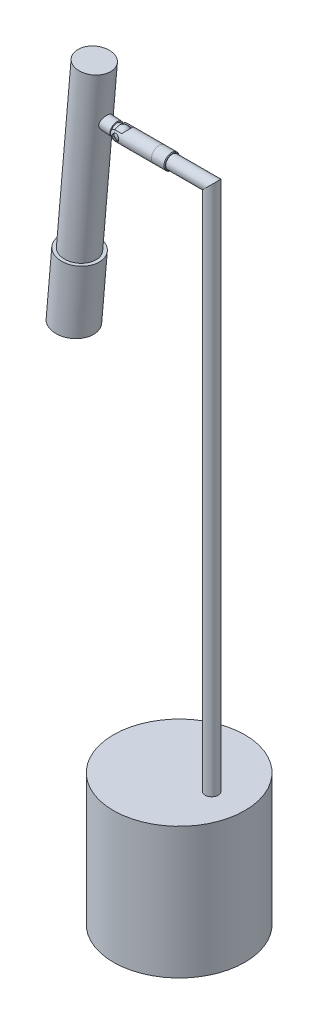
ISO-10303-21;
HEADER;
FILE_DESCRIPTION(('STEP AP214'),'2;1');
FILE_NAME('part.step','',(''),(''),'','','');
FILE_SCHEMA(('AUTOMOTIVE_DESIGN { 1 0 10303 214 1 1 1 1 }'));
ENDSEC;
DATA;
#1=APPLICATION_CONTEXT('core data for automotive mechanical design processes');
#2=APPLICATION_PROTOCOL_DEFINITION('international standard','automotive_design',2000,#1);
#3=PRODUCT_CONTEXT('',#1,'mechanical');
#4=PRODUCT('Part','Part','',(#3));
#5=PRODUCT_RELATED_PRODUCT_CATEGORY('part','',(#4));
#6=PRODUCT_DEFINITION_FORMATION('','',#4);
#7=PRODUCT_DEFINITION_CONTEXT('part definition',#1,'design');
#8=PRODUCT_DEFINITION('design','',#6,#7);
#9=PRODUCT_DEFINITION_SHAPE('','',#8);
#10=(LENGTH_UNIT() NAMED_UNIT(*) SI_UNIT(.MILLI.,.METRE.));
#11=(NAMED_UNIT(*) PLANE_ANGLE_UNIT() SI_UNIT($,.RADIAN.));
#12=(NAMED_UNIT(*) SI_UNIT($,.STERADIAN.) SOLID_ANGLE_UNIT());
#13=UNCERTAINTY_MEASURE_WITH_UNIT(LENGTH_MEASURE(1.E-05),#10,'distance_accuracy_value','');
#14=(GEOMETRIC_REPRESENTATION_CONTEXT(3) GLOBAL_UNCERTAINTY_ASSIGNED_CONTEXT((#13)) GLOBAL_UNIT_ASSIGNED_CONTEXT((#10,
#11,#12)) REPRESENTATION_CONTEXT('',''));
#15=CARTESIAN_POINT('',(0.,0.,0.));
#16=DIRECTION('',(0.,0.,1.));
#17=DIRECTION('',(1.,0.,0.));
#18=AXIS2_PLACEMENT_3D('',#15,#16,#17);
#19=CARTESIAN_POINT('',(-19.4004825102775,536.997829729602,-0.0386532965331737));
#20=DIRECTION('',(-0.0849780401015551,-0.99638221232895,0.00110437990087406));
#21=DIRECTION('',(-9.38480967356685E-05,-0.00110038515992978,-0.999999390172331));
#22=AXIS2_PLACEMENT_3D('',#19,#20,#21);
#23=CYLINDRICAL_SURFACE('',#22,12.5);
#24=CARTESIAN_POINT('',(-19.4004825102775,536.997829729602,-0.0386532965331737));
#25=DIRECTION('',(0.0849780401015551,0.99638221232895,-0.00110437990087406));
#26=DIRECTION('',(9.38480967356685E-05,0.00110038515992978,0.999999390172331));
#27=AXIS2_PLACEMENT_3D('',#24,#25,#26);
#28=CIRCLE('',#27,12.5);
#29=CARTESIAN_POINT('',(-19.3993094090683,537.011584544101,12.461339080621));
#30=VERTEX_POINT('',#29);
#31=EDGE_CURVE('P0_E25',#30,#30,#28,.T.);
#32=ORIENTED_EDGE('',*,*,#31,.F.);
#33=EDGE_LOOP('',(#32));
#34=FACE_BOUND('',#33,.T.);
#35=CARTESIAN_POINT('',(-30.4476277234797,407.468142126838,0.104916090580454));
#36=DIRECTION('',(0.0849780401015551,0.99638221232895,-0.00110437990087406));
#37=DIRECTION('',(9.38480967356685E-05,0.00110038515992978,0.999999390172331));
#38=AXIS2_PLACEMENT_3D('',#35,#36,#37);
#39=CIRCLE('',#38,12.5);
#40=CARTESIAN_POINT('',(-30.4464546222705,407.481896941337,12.6049084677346));
#41=VERTEX_POINT('',#40);
#42=EDGE_CURVE('P0_E29',#41,#41,#39,.T.);
#43=ORIENTED_EDGE('',*,*,#42,.T.);
#44=EDGE_LOOP('',(#43));
#45=FACE_BOUND('',#44,.T.);
#46=CARTESIAN_POINT('',(-10.9592454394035,501.156407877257,4.99999695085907));
#47=CARTESIAN_POINT('',(-10.9706290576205,501.022920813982,5.00014386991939));
#48=CARTESIAN_POINT('',(-10.9796693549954,500.889186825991,4.99490103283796));
#49=CARTESIAN_POINT('',(-10.9930474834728,500.622278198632,4.97368513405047));
#50=CARTESIAN_POINT('',(-10.9973824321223,500.489103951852,4.95770550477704));
#51=CARTESIAN_POINT('',(-11.0014991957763,500.224114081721,4.91514484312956));
#52=CARTESIAN_POINT('',(-11.0012718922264,500.092301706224,4.88854268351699));
#53=CARTESIAN_POINT('',(-10.996535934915,499.831222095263,4.82500354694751));
#54=CARTESIAN_POINT('',(-10.9920255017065,499.701955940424,4.78806227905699));
#55=CARTESIAN_POINT('',(-10.9791608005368,499.447437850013,4.70437547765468));
#56=CARTESIAN_POINT('',(-10.9708228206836,499.322171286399,4.65767194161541));
#57=CARTESIAN_POINT('',(-10.9508075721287,499.075860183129,4.55477029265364));
#58=CARTESIAN_POINT('',(-10.9391290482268,498.954817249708,4.49856861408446));
#59=CARTESIAN_POINT('',(-10.8999199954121,498.599287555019,4.31640974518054));
#60=CARTESIAN_POINT('',(-10.8681974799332,498.372082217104,4.17679350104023));
#61=CARTESIAN_POINT('',(-10.7966202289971,497.931472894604,3.85682861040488));
#62=CARTESIAN_POINT('',(-10.7564290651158,497.719395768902,3.674743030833));
#63=CARTESIAN_POINT('',(-10.6747001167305,497.327640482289,3.27841957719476));
#64=CARTESIAN_POINT('',(-10.6331618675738,497.147973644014,3.06417051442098));
#65=CARTESIAN_POINT('',(-10.5731406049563,496.903546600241,2.71807357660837));
#66=CARTESIAN_POINT('',(-10.5531561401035,496.825008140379,2.59599689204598));
#67=CARTESIAN_POINT('',(-10.5149696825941,496.678745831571,2.34528315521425));
#68=CARTESIAN_POINT('',(-10.496766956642,496.61101752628,2.21664883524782));
#69=CARTESIAN_POINT('',(-10.4627750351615,496.487007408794,1.95365421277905));
#70=CARTESIAN_POINT('',(-10.4469861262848,496.430726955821,1.81929323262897));
#71=CARTESIAN_POINT('',(-10.4183859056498,496.33023230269,1.54588804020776));
#72=CARTESIAN_POINT('',(-10.4055731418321,496.286012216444,1.40684614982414));
#73=CARTESIAN_POINT('',(-10.383908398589,496.211937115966,1.13187890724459));
#74=CARTESIAN_POINT('',(-10.3748957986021,496.181494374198,0.996124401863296));
#75=CARTESIAN_POINT('',(-10.3602771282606,496.13232363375,0.722384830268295));
#76=CARTESIAN_POINT('',(-10.3546695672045,496.113590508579,0.5844007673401));
#77=CARTESIAN_POINT('',(-10.347043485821,496.088039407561,0.307250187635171));
#78=CARTESIAN_POINT('',(-10.3450245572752,496.081220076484,0.168083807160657));
#79=CARTESIAN_POINT('',(-10.344643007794,496.079573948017,-0.110322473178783));
#80=CARTESIAN_POINT('',(-10.3462802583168,496.084746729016,-0.249562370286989));
#81=CARTESIAN_POINT('',(-10.3529610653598,496.106390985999,-0.51915721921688));
#82=CARTESIAN_POINT('',(-10.3578071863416,496.122208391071,-0.649570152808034));
#83=CARTESIAN_POINT('',(-10.3705615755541,496.164300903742,-0.908587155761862));
#84=CARTESIAN_POINT('',(-10.378470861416,496.190579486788,-1.03719060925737));
#85=CARTESIAN_POINT('',(-10.3971177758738,496.253324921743,-1.29163661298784));
#86=CARTESIAN_POINT('',(-10.4078544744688,496.289788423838,-1.41748005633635));
#87=CARTESIAN_POINT('',(-10.4318422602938,496.372555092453,-1.66565804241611));
#88=CARTESIAN_POINT('',(-10.445094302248,496.418861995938,-1.78799123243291));
#89=CARTESIAN_POINT('',(-10.4884985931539,496.573472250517,-2.1521064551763));
#90=CARTESIAN_POINT('',(-10.522019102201,496.696569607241,-2.38739439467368));
#91=CARTESIAN_POINT('',(-10.5940942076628,496.977785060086,-2.83500510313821));
#92=CARTESIAN_POINT('',(-10.6326505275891,497.135915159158,-3.04731996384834));
#93=CARTESIAN_POINT('',(-10.7129323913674,497.494496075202,-3.45790699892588));
#94=CARTESIAN_POINT('',(-10.7546998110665,497.697043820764,-3.65434201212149));
#95=CARTESIAN_POINT('',(-10.8331751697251,498.13232194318,-4.01198475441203));
#96=CARTESIAN_POINT('',(-10.8698814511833,498.365062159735,-4.17318095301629));
#97=CARTESIAN_POINT('',(-10.917149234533,498.735678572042,-4.38713342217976));
#98=CARTESIAN_POINT('',(-10.9317541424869,498.864781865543,-4.45455263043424));
#99=CARTESIAN_POINT('',(-10.9573139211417,499.128517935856,-4.57832726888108));
#100=CARTESIAN_POINT('',(-10.9682702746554,499.263148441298,-4.63468718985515));
#101=CARTESIAN_POINT('',(-10.9858412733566,499.536928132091,-4.73578895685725));
#102=CARTESIAN_POINT('',(-10.992457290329,499.67607587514,-4.78053447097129));
#103=CARTESIAN_POINT('',(-11.0007721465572,499.957837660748,-4.85794756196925));
#104=CARTESIAN_POINT('',(-11.0024713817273,500.100451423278,-4.89061611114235));
#105=CARTESIAN_POINT('',(-11.0005839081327,500.379149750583,-4.94186828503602));
#106=CARTESIAN_POINT('',(-10.9973137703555,500.515100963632,-4.96119042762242));
#107=CARTESIAN_POINT('',(-10.985860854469,500.787922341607,-4.98862435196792));
#108=CARTESIAN_POINT('',(-10.9776783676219,500.924792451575,-4.99673679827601));
#109=CARTESIAN_POINT('',(-10.9563720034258,501.198315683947,-5.00165565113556));
#110=CARTESIAN_POINT('',(-10.9432493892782,501.334968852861,-4.99846494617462));
#111=CARTESIAN_POINT('',(-10.9122099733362,501.606992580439,-4.98082378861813));
#112=CARTESIAN_POINT('',(-10.8942932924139,501.742363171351,-4.96637361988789));
#113=CARTESIAN_POINT('',(-10.8551347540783,502.003091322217,-4.92752546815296));
#114=CARTESIAN_POINT('',(-10.8341419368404,502.12857849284,-4.90374425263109));
#115=CARTESIAN_POINT('',(-10.7885649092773,502.376687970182,-4.84656318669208));
#116=CARTESIAN_POINT('',(-10.7639795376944,502.499309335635,-4.81316022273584));
#117=CARTESIAN_POINT('',(-10.685537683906,502.861689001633,-4.69895122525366));
#118=CARTESIAN_POINT('',(-10.6269641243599,503.096164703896,-4.604114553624));
#119=CARTESIAN_POINT('',(-10.4993724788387,503.554697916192,-4.37551924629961));
#120=CARTESIAN_POINT('',(-10.4300271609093,503.777947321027,-4.24033816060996));
#121=CARTESIAN_POINT('',(-10.2884272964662,504.199233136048,-3.9363448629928));
#122=CARTESIAN_POINT('',(-10.2161715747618,504.397259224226,-3.76751895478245));
#123=CARTESIAN_POINT('',(-10.0691728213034,504.77807299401,-3.38614722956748));
#124=CARTESIAN_POINT('',(-9.99464029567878,504.958654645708,-3.17129315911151));
#125=CARTESIAN_POINT('',(-9.89035906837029,505.20116574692,-2.82708012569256));
#126=CARTESIAN_POINT('',(-9.85683412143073,505.277312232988,-2.7086111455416));
#127=CARTESIAN_POINT('',(-9.79305003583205,505.419660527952,-2.46502678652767));
#128=CARTESIAN_POINT('',(-9.7627894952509,505.485866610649,-2.33991429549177));
#129=CARTESIAN_POINT('',(-9.70625467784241,505.607838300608,-2.08379825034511));
#130=CARTESIAN_POINT('',(-9.67998144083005,505.663601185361,-1.9527931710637));
#131=CARTESIAN_POINT('',(-9.63209279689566,505.764163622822,-1.68587271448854));
#132=CARTESIAN_POINT('',(-9.61047540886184,505.808967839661,-1.54995945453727));
#133=CARTESIAN_POINT('',(-9.57244884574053,505.887197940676,-1.27421593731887));
#134=CARTESIAN_POINT('',(-9.55603847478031,505.920626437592,-1.13438658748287));
#135=CARTESIAN_POINT('',(-9.5288583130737,505.975766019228,-0.851899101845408));
#136=CARTESIAN_POINT('',(-9.5180881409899,505.99747789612,-0.709241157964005));
#137=CARTESIAN_POINT('',(-9.50299208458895,506.027914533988,-0.431692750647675));
#138=CARTESIAN_POINT('',(-9.49829046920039,506.037396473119,-0.296905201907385));
#139=CARTESIAN_POINT('',(-9.49418058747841,506.045826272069,-0.026871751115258));
#140=CARTESIAN_POINT('',(-9.49477410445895,506.044770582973,0.108374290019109));
#141=CARTESIAN_POINT('',(-9.50124302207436,506.03213008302,0.378174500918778));
#142=CARTESIAN_POINT('',(-9.50711568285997,506.020550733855,0.512728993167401));
#143=CARTESIAN_POINT('',(-9.52399897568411,505.986982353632,0.780254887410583));
#144=CARTESIAN_POINT('',(-9.53501152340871,505.964989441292,0.913225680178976));
#145=CARTESIAN_POINT('',(-9.56149519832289,505.911646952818,1.17246551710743));
#146=CARTESIAN_POINT('',(-9.57681667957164,505.880610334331,1.29881427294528));
#147=CARTESIAN_POINT('',(-9.61169863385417,505.809233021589,1.54827169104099));
#148=CARTESIAN_POINT('',(-9.63126059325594,505.768889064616,1.6713792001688));
#149=CARTESIAN_POINT('',(-9.69570211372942,505.634366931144,2.03461654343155));
#150=CARTESIAN_POINT('',(-9.74636018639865,505.526654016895,2.26887535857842));
#151=CARTESIAN_POINT('',(-9.8614676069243,505.272729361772,2.72591150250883));
#152=CARTESIAN_POINT('',(-9.92642747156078,505.125026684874,2.94772400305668));
#153=CARTESIAN_POINT('',(-10.0633202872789,504.797181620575,3.36352440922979));
#154=CARTESIAN_POINT('',(-10.1352561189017,504.617025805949,3.55750073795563));
#155=CARTESIAN_POINT('',(-10.2848406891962,504.215642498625,3.92459553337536));
#156=CARTESIAN_POINT('',(-10.3625674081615,503.99256284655,4.09567939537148));
#157=CARTESIAN_POINT('',(-10.4746987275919,503.637339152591,4.32166944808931));
#158=CARTESIAN_POINT('',(-10.5113551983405,503.515410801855,4.39192938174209));
#159=CARTESIAN_POINT('',(-10.5823121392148,503.265331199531,4.52170127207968));
#160=CARTESIAN_POINT('',(-10.6166137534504,503.137183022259,4.58121847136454));
#161=CARTESIAN_POINT('',(-10.6790904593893,502.887164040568,4.6841454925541));
#162=CARTESIAN_POINT('',(-10.7075391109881,502.765756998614,4.72851987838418));
#163=CARTESIAN_POINT('',(-10.7611882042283,502.519165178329,4.80752592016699));
#164=CARTESIAN_POINT('',(-10.7863901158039,502.393982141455,4.84216199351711));
#165=CARTESIAN_POINT('',(-10.8329925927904,502.140861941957,4.9013211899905));
#166=CARTESIAN_POINT('',(-10.8544015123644,502.01293154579,4.92586669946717));
#167=CARTESIAN_POINT('',(-10.893069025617,501.75495707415,4.96469622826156));
#168=CARTESIAN_POINT('',(-10.9103300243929,501.624914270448,4.97898620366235));
#169=CARTESIAN_POINT('',(-10.9318473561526,501.438152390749,4.9919869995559));
#170=CARTESIAN_POINT('',(-10.9379068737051,501.381905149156,4.99493497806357));
#171=CARTESIAN_POINT('',(-10.9491991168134,501.269255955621,4.99890896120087));
#172=CARTESIAN_POINT('',(-10.9544317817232,501.212853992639,4.99993482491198));
#173=CARTESIAN_POINT('',(-10.9592454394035,501.156407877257,4.99999695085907));
#174=B_SPLINE_CURVE_WITH_KNOTS('',3,(#46,#47,#48,#49,#50,#51,#52,#53,#54,#55,#56,#57,#58,#59,
#60,#61,#62,#63,#64,#65,#66,#67,#68,#69,#70,#71,#72,#73,#74,#75,#76,#77,#78,#79,#80,#81,#82,#83,
#84,#85,#86,#87,#88,#89,#90,#91,#92,#93,#94,#95,#96,#97,#98,#99,#100,#101,#102,#103,#104,#105,
#106,#107,#108,#109,#110,#111,#112,#113,#114,#115,#116,#117,#118,#119,#120,#121,#122,#123,#124,
#125,#126,#127,#128,#129,#130,#131,#132,#133,#134,#135,#136,#137,#138,#139,#140,#141,#142,#143,
#144,#145,#146,#147,#148,#149,#150,#151,#152,#153,#154,#155,#156,#157,#158,#159,#160,#161,#162,
#163,#164,#165,#166,#167,#168,#169,#170,#171,#172,#173),.UNSPECIFIED.,.T.,.F.,(4,2,2,2,2,2,2,2,
2,2,2,2,2,2,2,2,2,2,2,2,2,2,2,2,2,2,2,2,2,2,2,2,2,2,2,2,2,2,2,2,2,2,2,2,2,2,2,2,2,2,2,2,2,2,2,2,
2,2,2,2,2,2,2,4),(0.,0.401857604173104,0.803961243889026,1.20686864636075,1.6099435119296,
2.0113187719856,2.41284504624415,3.21490370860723,4.05855844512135,4.90250734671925,
5.34162944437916,5.78057004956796,6.21956274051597,6.65834079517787,7.0760537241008,
7.4935836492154,7.91106607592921,8.32853382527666,8.72244339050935,9.11648393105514,
9.51039502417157,9.90445593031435,10.7036345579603,11.5030874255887,12.3550281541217,
13.207247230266,13.645908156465,14.0843905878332,14.5227343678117,14.961042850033,
15.3725755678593,15.7840838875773,16.1954870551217,16.6068798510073,16.9947241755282,
17.3826941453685,18.1580219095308,18.9647918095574,19.7718908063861,20.6386062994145,
21.0724736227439,21.5061538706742,21.9399470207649,22.3735552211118,22.8070637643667,
23.2405429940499,23.6456433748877,24.050880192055,24.4559068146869,24.8610845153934,
25.2536349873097,25.646323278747,26.4310478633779,27.2504496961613,28.0701913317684,
28.9406797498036,29.3764938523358,29.8120946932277,30.2087331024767,30.6051913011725,
31.0007651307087,31.3961090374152,31.5660254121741,31.735954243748),.UNSPECIFIED.);
#175=CARTESIAN_POINT('',(-10.9592454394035,501.156407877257,4.99999695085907));
#176=VERTEX_POINT('',#175);
#177=EDGE_CURVE('P0_E9',#176,#176,#174,.T.);
#178=ORIENTED_EDGE('',*,*,#177,.F.);
#179=EDGE_LOOP('',(#178));
#180=FACE_BOUND('',#179,.T.);
#181=ADVANCED_FACE('P0_F14',(#34,#45,#180),#23,.T.);
#182=CARTESIAN_POINT('',(-19.4004825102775,536.997829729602,-0.0386532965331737));
#183=DIRECTION('',(0.0849780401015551,0.99638221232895,-0.00110437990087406));
#184=DIRECTION('',(9.38480967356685E-05,0.00110038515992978,0.999999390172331));
#185=AXIS2_PLACEMENT_3D('',#182,#183,#184);
#186=PLANE('',#185);
#187=ORIENTED_EDGE('',*,*,#31,.T.);
#188=EDGE_LOOP('',(#187));
#189=FACE_BOUND('',#188,.T.);
#190=ADVANCED_FACE('P0_F50',(#189),#186,.T.);
#191=CARTESIAN_POINT('',(-30.4476277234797,407.468142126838,0.104916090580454));
#192=DIRECTION('',(0.0849780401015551,0.99638221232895,-0.00110437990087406));
#193=DIRECTION('',(9.38480967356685E-05,0.00110038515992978,0.999999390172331));
#194=AXIS2_PLACEMENT_3D('',#191,#192,#193);
#195=PLANE('',#194);
#196=ORIENTED_EDGE('',*,*,#42,.F.);
#197=EDGE_LOOP('',(#196));
#198=FACE_BOUND('',#197,.T.);
#199=ADVANCED_FACE('P0_F43',(#198),#195,.F.);
#200=CARTESIAN_POINT('',(-2.4470575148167,500.424890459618,-2.5950243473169E-12));
#201=DIRECTION('',(-0.996382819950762,0.0849780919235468,0.));
#202=DIRECTION('',(9.38480967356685E-05,0.00110038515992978,0.999999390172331));
#203=AXIS2_PLACEMENT_3D('',#200,#201,#202);
#204=CYLINDRICAL_SURFACE('',#203,5.);
#205=CARTESIAN_POINT('',(-2.4470575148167,500.424890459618,-2.5950243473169E-12));
#206=DIRECTION('',(0.996382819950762,-0.0849780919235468,0.));
#207=DIRECTION('',(-9.38480967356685E-05,-0.00110038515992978,-0.999999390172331));
#208=AXIS2_PLACEMENT_3D('',#205,#206,#207);
#209=CIRCLE('',#208,5.);
#210=CARTESIAN_POINT('',(-2.44752675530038,500.419388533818,-4.99999695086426));
#211=VERTEX_POINT('',#210);
#212=EDGE_CURVE('P0_E34',#211,#211,#209,.T.);
#213=ORIENTED_EDGE('',*,*,#212,.F.);
#214=EDGE_LOOP('',(#213));
#215=FACE_BOUND('',#214,.T.);
#216=ORIENTED_EDGE('',*,*,#177,.T.);
#217=EDGE_LOOP('',(#216));
#218=FACE_BOUND('',#217,.T.);
#219=ADVANCED_FACE('P0_F41',(#215,#218),#204,.T.);
#220=CARTESIAN_POINT('',(-2.4470575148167,500.424890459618,-2.5950243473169E-12));
#221=DIRECTION('',(0.996382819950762,-0.0849780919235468,0.));
#222=DIRECTION('',(-9.38480967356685E-05,-0.00110038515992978,-0.999999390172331));
#223=AXIS2_PLACEMENT_3D('',#220,#221,#222);
#224=PLANE('',#223);
#225=ORIENTED_EDGE('',*,*,#212,.T.);
#226=EDGE_LOOP('',(#225));
#227=FACE_BOUND('',#226,.T.);
#228=ADVANCED_FACE('P0_F39',(#227),#224,.T.);
#229=CLOSED_SHELL('',(#181,#190,#199,#219,#228));
#230=MANIFOLD_SOLID_BREP('P0_B1',#229);
#231=CARTESIAN_POINT('',(-34.6965297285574,357.649031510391,0.160135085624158));
#232=DIRECTION('',(0.0849780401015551,0.99638221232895,-0.00110437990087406));
#233=DIRECTION('',(9.38480967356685E-05,0.00110038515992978,0.999999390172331));
#234=AXIS2_PLACEMENT_3D('',#231,#232,#233);
#235=CYLINDRICAL_SURFACE('',#234,15.);
#236=CARTESIAN_POINT('',(-34.6965297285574,357.649031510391,0.160135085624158));
#237=DIRECTION('',(-0.0849780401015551,-0.99638221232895,0.00110437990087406));
#238=DIRECTION('',(-9.38480967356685E-05,-0.00110038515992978,-0.999999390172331));
#239=AXIS2_PLACEMENT_3D('',#236,#237,#238);
#240=CIRCLE('',#239,15.);
#241=CARTESIAN_POINT('',(-34.6979374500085,357.632525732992,-14.8398557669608));
#242=VERTEX_POINT('',#241);
#243=EDGE_CURVE('P1_E10',#242,#242,#240,.T.);
#244=ORIENTED_EDGE('',*,*,#243,.F.);
#245=EDGE_LOOP('',(#244));
#246=FACE_BOUND('',#245,.T.);
#247=CARTESIAN_POINT('',(-30.4476277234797,407.468142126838,0.104916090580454));
#248=DIRECTION('',(-0.0849780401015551,-0.99638221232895,0.00110437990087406));
#249=DIRECTION('',(-9.38480967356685E-05,-0.00110038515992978,-0.999999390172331));
#250=AXIS2_PLACEMENT_3D('',#247,#248,#249);
#251=CIRCLE('',#250,15.);
#252=CARTESIAN_POINT('',(-30.4490354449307,407.451636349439,-14.8950747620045));
#253=VERTEX_POINT('',#252);
#254=EDGE_CURVE('P1_E18',#253,#253,#251,.T.);
#255=ORIENTED_EDGE('',*,*,#254,.T.);
#256=EDGE_LOOP('',(#255));
#257=FACE_BOUND('',#256,.T.);
#258=ADVANCED_FACE('P1_F15',(#246,#257),#235,.T.);
#259=CARTESIAN_POINT('',(-34.6965297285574,357.649031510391,0.160135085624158));
#260=DIRECTION('',(-0.0849780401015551,-0.99638221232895,0.00110437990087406));
#261=DIRECTION('',(-9.38480967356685E-05,-0.00110038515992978,-0.999999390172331));
#262=AXIS2_PLACEMENT_3D('',#259,#260,#261);
#263=PLANE('',#262);
#264=ORIENTED_EDGE('',*,*,#243,.T.);
#265=EDGE_LOOP('',(#264));
#266=FACE_BOUND('',#265,.T.);
#267=ADVANCED_FACE('P1_F30',(#266),#263,.T.);
#268=CARTESIAN_POINT('',(-30.4476277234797,407.468142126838,0.104916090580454));
#269=DIRECTION('',(-0.0849780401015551,-0.99638221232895,0.00110437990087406));
#270=DIRECTION('',(-9.38480967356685E-05,-0.00110038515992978,-0.999999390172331));
#271=AXIS2_PLACEMENT_3D('',#268,#269,#270);
#272=PLANE('',#271);
#273=ORIENTED_EDGE('',*,*,#254,.F.);
#274=EDGE_LOOP('',(#273));
#275=FACE_BOUND('',#274,.T.);
#276=ADVANCED_FACE('P1_F28',(#275),#272,.F.);
#277=CLOSED_SHELL('',(#258,#267,#276));
#278=MANIFOLD_SOLID_BREP('P1_B1',#277);
#279=CARTESIAN_POINT('',(1.,500.,-2.59846320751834E-12));
#280=DIRECTION('',(-1.,0.,0.));
#281=DIRECTION('',(0.,0.,1.));
#282=AXIS2_PLACEMENT_3D('',#279,#280,#281);
#283=DEGENERATE_TOROIDAL_SURFACE('',#282,0.849999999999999,5.,.T.);
#284=CARTESIAN_POINT('',(1.0002,501.973532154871,5.50705645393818));
#285=CARTESIAN_POINT('',(0.946140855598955,501.931504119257,5.52212372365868));
#286=CARTESIAN_POINT('',(0.893704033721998,501.887155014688,5.53654114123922));
#287=CARTESIAN_POINT('',(0.792466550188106,501.794100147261,5.56405002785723));
#288=CARTESIAN_POINT('',(0.743666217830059,501.745393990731,5.57714137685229));
#289=CARTESIAN_POINT('',(0.650099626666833,501.643914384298,5.60197008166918));
#290=CARTESIAN_POINT('',(0.605333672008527,501.591140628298,5.61370733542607));
#291=CARTESIAN_POINT('',(0.520218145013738,501.481902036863,5.63580410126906));
#292=CARTESIAN_POINT('',(0.479868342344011,501.425437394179,5.64616368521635));
#293=CARTESIAN_POINT('',(0.365871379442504,501.250910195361,5.67517590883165));
#294=CARTESIAN_POINT('',(0.29930251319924,501.127742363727,5.69175524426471));
#295=CARTESIAN_POINT('',(0.187555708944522,500.871617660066,5.71926907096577));
#296=CARTESIAN_POINT('',(0.14236650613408,500.738665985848,5.73020653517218));
#297=CARTESIAN_POINT('',(0.0753576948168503,500.468896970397,5.74633152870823));
#298=CARTESIAN_POINT('',(0.0531785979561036,500.332174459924,5.75160755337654));
#299=CARTESIAN_POINT('',(0.0316890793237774,500.056818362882,5.75672046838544));
#300=CARTESIAN_POINT('',(0.0323826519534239,499.918184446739,5.75655640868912));
#301=CARTESIAN_POINT('',(0.0565079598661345,499.644313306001,5.75081433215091));
#302=CARTESIAN_POINT('',(0.0797310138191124,499.50905658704,5.74528600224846));
#303=CARTESIAN_POINT('',(0.147847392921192,499.244455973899,5.72887967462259));
#304=CARTESIAN_POINT('',(0.192740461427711,499.115112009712,5.71800174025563));
#305=CARTESIAN_POINT('',(0.302869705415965,498.865585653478,5.69086698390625));
#306=CARTESIAN_POINT('',(0.368163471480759,498.745430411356,5.67459492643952));
#307=CARTESIAN_POINT('',(0.516945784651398,498.517949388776,5.63672511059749));
#308=CARTESIAN_POINT('',(0.600423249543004,498.410615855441,5.61513059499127));
#309=CARTESIAN_POINT('',(0.739147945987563,498.259193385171,5.57835064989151));
#310=CARTESIAN_POINT('',(0.788808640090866,498.209403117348,5.56503770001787));
#311=CARTESIAN_POINT('',(0.891818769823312,498.114444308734,5.53705936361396));
#312=CARTESIAN_POINT('',(0.945160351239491,498.06926640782,5.52239683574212));
#313=CARTESIAN_POINT('',(1.0002,498.026467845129,5.50705645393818));
#314=B_SPLINE_CURVE_WITH_KNOTS('',3,(#284,#285,#286,#287,#288,#289,#290,#291,#292,#293,#294,
#295,#296,#297,#298,#299,#300,#301,#302,#303,#304,#305,#306,#307,#308,#309,#310,#311,#312,#313),
.UNSPECIFIED.,.F.,.F.,(4,2,2,2,2,2,2,2,2,2,2,2,2,2,4),(0.,0.210278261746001,0.420575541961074,
0.630888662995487,0.841190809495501,1.26190972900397,1.68240672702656,2.09623055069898,
2.51012664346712,2.92022523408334,3.33031896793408,3.74158100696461,4.15259309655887,
4.36708305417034,4.58112870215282),.UNSPECIFIED.);
#315=CARTESIAN_POINT('',(1.,501.973376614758,5.50711219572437));
#316=VERTEX_POINT('',#315);
#317=CARTESIAN_POINT('',(1.,498.026623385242,5.50711219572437));
#318=VERTEX_POINT('',#317);
#319=EDGE_CURVE('P2_E32',#316,#318,#314,.T.);
#320=ORIENTED_EDGE('',*,*,#319,.F.);
#321=CARTESIAN_POINT('',(1.,500.,-2.59846320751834E-12));
#322=DIRECTION('',(-1.,0.,0.));
#323=DIRECTION('',(0.,0.,1.));
#324=AXIS2_PLACEMENT_3D('',#321,#322,#323);
#325=CIRCLE('',#324,5.85);
#326=CARTESIAN_POINT('',(1.,503.737980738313,4.4999999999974));
#327=VERTEX_POINT('',#326);
#328=EDGE_CURVE('P2_E253',#327,#316,#325,.F.);
#329=ORIENTED_EDGE('',*,*,#328,.F.);
#330=CARTESIAN_POINT('',(-2.41723572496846,500.,4.4999999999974));
#331=CARTESIAN_POINT('',(-2.41723329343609,500.226509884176,4.4999999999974));
#332=CARTESIAN_POINT('',(-2.39896564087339,500.453195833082,4.4999999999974));
#333=CARTESIAN_POINT('',(-2.32568550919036,500.900852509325,4.4999999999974));
#334=CARTESIAN_POINT('',(-2.27062007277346,501.121814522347,4.4999999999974));
#335=CARTESIAN_POINT('',(-2.12165977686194,501.556875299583,4.4999999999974));
#336=CARTESIAN_POINT('',(-2.02678918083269,501.770644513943,4.4999999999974));
#337=CARTESIAN_POINT('',(-1.79910344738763,502.176891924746,4.4999999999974));
#338=CARTESIAN_POINT('',(-1.66632117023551,502.369388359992,4.4999999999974));
#339=CARTESIAN_POINT('',(-1.37910295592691,502.708930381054,4.4999999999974));
#340=CARTESIAN_POINT('',(-1.22765105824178,502.858497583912,4.4999999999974));
#341=CARTESIAN_POINT('',(-0.899578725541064,503.126909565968,4.4999999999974));
#342=CARTESIAN_POINT('',(-0.722972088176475,503.245771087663,4.4999999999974));
#343=CARTESIAN_POINT('',(-0.367429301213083,503.438203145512,4.4999999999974));
#344=CARTESIAN_POINT('',(-0.190197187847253,503.514930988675,4.4999999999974));
#345=CARTESIAN_POINT('',(0.175064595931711,503.63571635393,4.4999999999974));
#346=CARTESIAN_POINT('',(0.363090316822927,503.679785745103,4.4999999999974));
#347=CARTESIAN_POINT('',(0.734202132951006,503.732124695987,4.4999999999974));
#348=CARTESIAN_POINT('',(0.917047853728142,503.742112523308,4.4999999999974));
#349=CARTESIAN_POINT('',(1.28174966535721,503.730755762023,4.4999999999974));
#350=CARTESIAN_POINT('',(1.46360589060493,503.709415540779,4.4999999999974));
#351=CARTESIAN_POINT('',(1.81845909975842,503.636721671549,4.4999999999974));
#352=CARTESIAN_POINT('',(1.99154594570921,503.585804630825,4.4999999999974));
#353=CARTESIAN_POINT('',(2.32691281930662,503.456093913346,4.4999999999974));
#354=CARTESIAN_POINT('',(2.48919261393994,503.377299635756,4.4999999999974));
#355=CARTESIAN_POINT('',(2.80142026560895,503.192964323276,4.4999999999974));
#356=CARTESIAN_POINT('',(2.95111662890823,503.086998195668,4.4999999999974));
#357=CARTESIAN_POINT('',(3.23160824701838,502.852509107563,4.4999999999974));
#358=CARTESIAN_POINT('',(3.36240052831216,502.723982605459,4.4999999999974));
#359=CARTESIAN_POINT('',(3.60837381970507,502.441624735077,4.4999999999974));
#360=CARTESIAN_POINT('',(3.72249203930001,502.286869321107,4.4999999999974));
#361=CARTESIAN_POINT('',(3.92539029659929,501.961594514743,4.4999999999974));
#362=CARTESIAN_POINT('',(4.01416239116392,501.7910702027,4.4999999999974));
#363=CARTESIAN_POINT('',(4.17171756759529,501.424435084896,4.4999999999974));
#364=CARTESIAN_POINT('',(4.23828052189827,501.227371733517,4.4999999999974));
#365=CARTESIAN_POINT('',(4.34062555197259,500.825395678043,4.4999999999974));
#366=CARTESIAN_POINT('',(4.37639085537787,500.620478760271,4.4999999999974));
#367=CARTESIAN_POINT('',(4.41920512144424,500.187828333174,4.4999999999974));
#368=CARTESIAN_POINT('',(4.42318101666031,499.959786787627,4.4999999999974));
#369=CARTESIAN_POINT('',(4.39432907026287,499.505964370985,4.4999999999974));
#370=CARTESIAN_POINT('',(4.36148790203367,499.280184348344,4.4999999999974));
#371=CARTESIAN_POINT('',(4.25690283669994,498.82906661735,4.4999999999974));
#372=CARTESIAN_POINT('',(4.18379449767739,498.604040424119,4.4999999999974));
#373=CARTESIAN_POINT('',(3.99798595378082,498.170919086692,4.4999999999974));
#374=CARTESIAN_POINT('',(3.8853061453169,497.962815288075,4.4999999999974));
#375=CARTESIAN_POINT('',(3.63140950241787,497.585865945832,4.4999999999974));
#376=CARTESIAN_POINT('',(3.49277806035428,497.415284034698,4.4999999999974));
#377=CARTESIAN_POINT('',(3.18599011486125,497.103099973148,4.4999999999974));
#378=CARTESIAN_POINT('',(3.01785268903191,496.961479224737,4.4999999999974));
#379=CARTESIAN_POINT('',(2.67516658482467,496.725941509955,4.4999999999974));
#380=CARTESIAN_POINT('',(2.5029074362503,496.628686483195,4.4999999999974));
#381=CARTESIAN_POINT('',(2.14370530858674,496.466746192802,4.4999999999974));
#382=CARTESIAN_POINT('',(1.95676861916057,496.402047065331,4.4999999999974));
#383=CARTESIAN_POINT('',(1.58639725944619,496.310872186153,4.4999999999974));
#384=CARTESIAN_POINT('',(1.40349265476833,496.282232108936,4.4999999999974));
#385=CARTESIAN_POINT('',(1.03549619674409,496.25690251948,4.4999999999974));
#386=CARTESIAN_POINT('',(0.85040478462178,496.260206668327,4.4999999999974));
#387=CARTESIAN_POINT('',(0.48801858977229,496.29816373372,4.4999999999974));
#388=CARTESIAN_POINT('',(0.31064349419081,496.33205692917,4.4999999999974));
#389=CARTESIAN_POINT('',(-0.0359604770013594,496.428922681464,4.4999999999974));
#390=CARTESIAN_POINT('',(-0.205189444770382,496.491894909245,4.4999999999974));
#391=CARTESIAN_POINT('',(-0.532288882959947,496.645345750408,4.4999999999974));
#392=CARTESIAN_POINT('',(-0.690058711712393,496.736038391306,4.4999999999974));
#393=CARTESIAN_POINT('',(-0.988850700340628,496.941685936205,4.4999999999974));
#394=CARTESIAN_POINT('',(-1.12987177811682,497.056642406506,4.4999999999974));
#395=CARTESIAN_POINT('',(-1.39725495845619,497.312061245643,4.4999999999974));
#396=CARTESIAN_POINT('',(-1.52283463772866,497.453341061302,4.4999999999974));
#397=CARTESIAN_POINT('',(-1.75040046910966,497.753790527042,4.4999999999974));
#398=CARTESIAN_POINT('',(-1.85237430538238,497.912969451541,4.4999999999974));
#399=CARTESIAN_POINT('',(-2.03790963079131,498.256811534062,4.4999999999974));
#400=CARTESIAN_POINT('',(-2.11959033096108,498.442486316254,4.4999999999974));
#401=CARTESIAN_POINT('',(-2.25363440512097,498.823960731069,4.4999999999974));
#402=CARTESIAN_POINT('',(-2.30601640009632,499.019753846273,4.4999999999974));
#403=CARTESIAN_POINT('',(-2.36829245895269,499.346990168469,4.4999999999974));
#404=CARTESIAN_POINT('',(-2.38664660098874,499.476894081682,4.4999999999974));
#405=CARTESIAN_POINT('',(-2.41111926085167,499.737845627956,4.4999999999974));
#406=CARTESIAN_POINT('',(-2.41723713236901,499.868893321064,4.4999999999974));
#407=CARTESIAN_POINT('',(-2.41723572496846,500.,4.4999999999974));
#408=B_SPLINE_CURVE_WITH_KNOTS('',3,(#330,#331,#332,#333,#334,#335,#336,#337,#338,#339,#340,
#341,#342,#343,#344,#345,#346,#347,#348,#349,#350,#351,#352,#353,#354,#355,#356,#357,#358,#359,
#360,#361,#362,#363,#364,#365,#366,#367,#368,#369,#370,#371,#372,#373,#374,#375,#376,#377,#378,
#379,#380,#381,#382,#383,#384,#385,#386,#387,#388,#389,#390,#391,#392,#393,#394,#395,#396,#397,
#398,#399,#400,#401,#402,#403,#404,#405,#406,#407),.UNSPECIFIED.,.T.,.F.,(4,2,2,2,2,2,2,2,2,2,2,
2,2,2,2,2,2,2,2,2,2,2,2,2,2,2,2,2,2,2,2,2,2,2,2,2,2,2,4),(0.,0.679084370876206,1.35914815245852,
2.05695781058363,2.75416446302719,3.38924130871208,4.02397113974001,4.60039843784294,
5.17661614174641,5.72331600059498,6.26993965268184,6.8086921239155,7.34745620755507,
7.89522651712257,8.44308289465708,9.01747133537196,9.5920395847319,10.2134580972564,
10.8352148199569,11.5164274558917,12.1978867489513,12.9039999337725,13.6097496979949,
14.2655300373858,14.9208879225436,15.5112515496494,16.1013635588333,16.6540423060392,
17.2066113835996,17.7458232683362,18.2850290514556,18.8285079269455,19.3720218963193,
19.936652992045,20.5015780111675,21.1076282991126,21.7132929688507,22.1063345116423,
22.4993968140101),.UNSPECIFIED.);
#409=CARTESIAN_POINT('',(1.,496.262019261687,4.4999999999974));
#410=VERTEX_POINT('',#409);
#411=EDGE_CURVE('P2_E232',#410,#327,#408,.T.);
#412=ORIENTED_EDGE('',*,*,#411,.F.);
#413=EDGE_CURVE('P2_E250',#318,#410,#325,.F.);
#414=ORIENTED_EDGE('',*,*,#413,.F.);
#415=EDGE_LOOP('',(#320,#329,#412,#414));
#416=FACE_BOUND('',#415,.T.);
#417=ADVANCED_FACE('P2_F17',(#416),#283,.T.);
#418=CARTESIAN_POINT('',(-4.,500.,-2.59846320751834E-12));
#419=DIRECTION('',(1.,0.,0.));
#420=DIRECTION('',(0.,0.,-1.));
#421=AXIS2_PLACEMENT_3D('',#418,#419,#420);
#422=CYLINDRICAL_SURFACE('',#421,5.85);
#423=ORIENTED_EDGE('',*,*,#328,.T.);
#424=CARTESIAN_POINT('',(1.,501.973376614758,5.50711219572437));
#425=CARTESIAN_POINT('',(1.05320261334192,502.014751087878,5.49228617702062));
#426=CARTESIAN_POINT('',(1.1080936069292,502.053994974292,5.47769797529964));
#427=CARTESIAN_POINT('',(1.22104350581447,502.128019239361,5.44936737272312));
#428=CARTESIAN_POINT('',(1.27910361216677,502.162797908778,5.43562529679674));
#429=CARTESIAN_POINT('',(1.45791016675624,502.260223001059,5.39618591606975));
#430=CARTESIAN_POINT('',(1.58305821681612,502.315783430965,5.37234068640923));
#431=CARTESIAN_POINT('',(1.84225812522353,502.406076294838,5.33251993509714));
#432=CARTESIAN_POINT('',(1.97633480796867,502.440747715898,5.31656749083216));
#433=CARTESIAN_POINT('',(2.24897880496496,502.487435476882,5.29488906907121));
#434=CARTESIAN_POINT('',(2.38753655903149,502.499497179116,5.2891426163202));
#435=CARTESIAN_POINT('',(2.65623077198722,502.500442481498,5.28869295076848));
#436=CARTESIAN_POINT('',(2.78636384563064,502.490698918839,5.29333564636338));
#437=CARTESIAN_POINT('',(3.04296700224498,502.451262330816,5.3117112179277));
#438=CARTESIAN_POINT('',(3.1694347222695,502.421556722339,5.32544982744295));
#439=CARTESIAN_POINT('',(3.4143645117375,502.343686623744,5.36016930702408));
#440=CARTESIAN_POINT('',(3.53288008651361,502.29566403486,5.3810943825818));
#441=CARTESIAN_POINT('',(3.76044678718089,502.182677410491,5.42790454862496));
#442=CARTESIAN_POINT('',(3.86949601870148,502.117709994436,5.4537906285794));
#443=CARTESIAN_POINT('',(4.08492087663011,501.966234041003,5.51030723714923));
#444=CARTESIAN_POINT('',(4.19028464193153,501.878365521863,5.54115396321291));
#445=CARTESIAN_POINT('',(4.3853531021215,501.686531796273,5.60252169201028));
#446=CARTESIAN_POINT('',(4.47505084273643,501.582559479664,5.63304254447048));
#447=CARTESIAN_POINT('',(4.64071420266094,501.355043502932,5.69217357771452));
#448=CARTESIAN_POINT('',(4.7157527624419,501.23077472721,5.72060837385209));
#449=CARTESIAN_POINT('',(4.84357413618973,500.9699907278,5.7705461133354));
#450=CARTESIAN_POINT('',(4.89636673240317,500.833480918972,5.79205210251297));
#451=CARTESIAN_POINT('',(4.97546234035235,500.559263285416,5.82475958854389));
#452=CARTESIAN_POINT('',(5.0029558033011,500.421955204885,5.83642175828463));
#453=CARTESIAN_POINT('',(5.03459850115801,500.144220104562,5.84987130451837));
#454=CARTESIAN_POINT('',(5.03875839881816,500.003794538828,5.85166319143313));
#455=CARTESIAN_POINT('',(5.02407512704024,499.733843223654,5.8453983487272));
#456=CARTESIAN_POINT('',(5.00675021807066,499.604216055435,5.83799160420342));
#457=CARTESIAN_POINT('',(4.95235717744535,499.349923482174,5.81517002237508));
#458=CARTESIAN_POINT('',(4.91528800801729,499.225258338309,5.79975476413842));
#459=CARTESIAN_POINT('',(4.82230059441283,498.982831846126,5.76221137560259));
#460=CARTESIAN_POINT('',(4.76619782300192,498.865151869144,5.74001774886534));
#461=CARTESIAN_POINT('',(4.63696108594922,498.64060515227,5.6910255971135));
#462=CARTESIAN_POINT('',(4.56382130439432,498.533742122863,5.66422550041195));
#463=CARTESIAN_POINT('',(4.39645024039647,498.325614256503,5.60637408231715));
#464=CARTESIAN_POINT('',(4.30107549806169,498.225314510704,5.57515545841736));
#465=CARTESIAN_POINT('',(4.09497148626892,498.041656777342,5.51332940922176));
#466=CARTESIAN_POINT('',(3.98423540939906,497.958306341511,5.48272226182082));
#467=CARTESIAN_POINT('',(3.7448735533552,497.807588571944,5.4242647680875));
#468=CARTESIAN_POINT('',(3.61569718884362,497.741025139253,5.39658086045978));
#469=CARTESIAN_POINT('',(3.3465064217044,497.630964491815,5.34918667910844));
#470=CARTESIAN_POINT('',(3.2064990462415,497.587452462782,5.3294712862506));
#471=CARTESIAN_POINT('',(2.92884100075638,497.52741475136,5.30187296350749));
#472=CARTESIAN_POINT('',(2.79158350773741,497.509381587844,5.29333151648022));
#473=CARTESIAN_POINT('',(2.51578008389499,497.496269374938,5.28714473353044));
#474=CARTESIAN_POINT('',(2.37723500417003,497.501176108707,5.2894926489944));
#475=CARTESIAN_POINT('',(2.11357789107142,497.532439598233,5.30413909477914));
#476=CARTESIAN_POINT('',(1.98822752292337,497.55719154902,5.315692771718));
#477=CARTESIAN_POINT('',(1.74353215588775,497.625145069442,5.34639518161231));
#478=CARTESIAN_POINT('',(1.62419121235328,497.668358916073,5.36554896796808));
#479=CARTESIAN_POINT('',(1.41808536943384,497.761064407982,5.4047792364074));
#480=CARTESIAN_POINT('',(1.32968582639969,497.80741213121,5.42384665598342));
#481=CARTESIAN_POINT('',(1.15963648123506,497.909880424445,5.46414751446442));
#482=CARTESIAN_POINT('',(1.07796762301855,497.965971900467,5.4853744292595));
#483=CARTESIAN_POINT('',(1.,498.026623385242,5.50711219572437));
#484=B_SPLINE_CURVE_WITH_KNOTS('',3,(#424,#425,#426,#427,#428,#429,#430,#431,#432,#433,#434,
#435,#436,#437,#438,#439,#440,#441,#442,#443,#444,#445,#446,#447,#448,#449,#450,#451,#452,#453,
#454,#455,#456,#457,#458,#459,#460,#461,#462,#463,#464,#465,#466,#467,#468,#469,#470,#471,#472,
#473,#474,#475,#476,#477,#478,#479,#480,#481,#482,#483),.UNSPECIFIED.,.F.,.F.,(4,2,2,2,2,2,2,2,
2,2,2,2,2,2,2,2,2,2,2,2,2,2,2,2,2,2,2,2,2,4),(0.,0.206914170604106,0.413907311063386,
0.828759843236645,1.24481828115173,1.66004107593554,2.04986153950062,2.43992795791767,
2.82703197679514,3.21421328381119,3.63424515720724,4.05446301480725,4.49599095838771,
4.93732454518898,5.3566340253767,5.77575187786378,6.166868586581,6.55800585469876,
6.95304895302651,7.34822710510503,7.77200924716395,8.19597979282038,8.6374905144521,
9.07871714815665,9.49255527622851,9.90613696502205,10.289288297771,10.672694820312,
10.9768513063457,11.2801147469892),.UNSPECIFIED.);
#485=EDGE_CURVE('P2_E192',#316,#318,#484,.T.);
#486=ORIENTED_EDGE('',*,*,#485,.T.);
#487=ORIENTED_EDGE('',*,*,#413,.T.);
#488=DIRECTION('',(1.,0.,0.));
#489=VECTOR('',#488,1.);
#490=CARTESIAN_POINT('',(-4.,496.262019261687,4.4999999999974));
#491=LINE('',#490,#489);
#492=CARTESIAN_POINT('',(6.00000000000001,496.262019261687,4.4999999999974));
#493=VERTEX_POINT('',#492);
#494=EDGE_CURVE('P2_E170',#410,#493,#491,.T.);
#495=ORIENTED_EDGE('',*,*,#494,.T.);
#496=CARTESIAN_POINT('',(6.00000000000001,496.262019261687,4.4999999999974));
#497=CARTESIAN_POINT('',(6.10678964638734,496.145982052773,4.40358474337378));
#498=CARTESIAN_POINT('',(6.21182737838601,496.032629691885,4.30186378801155));
#499=CARTESIAN_POINT('',(6.41739682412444,495.811953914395,4.0873664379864));
#500=CARTESIAN_POINT('',(6.51792037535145,495.704641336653,3.97457110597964));
#501=CARTESIAN_POINT('',(6.7140106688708,495.496123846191,3.73668482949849));
#502=CARTESIAN_POINT('',(6.80952093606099,495.39498701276,3.61148679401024));
#503=CARTESIAN_POINT('',(6.9930499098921,495.201235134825,3.34976036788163));
#504=CARTESIAN_POINT('',(7.08107383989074,495.108614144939,3.21324001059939));
#505=CARTESIAN_POINT('',(7.29213368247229,494.88703997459,2.85393753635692));
#506=CARTESIAN_POINT('',(7.40930679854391,494.764522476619,2.62347901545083));
#507=CARTESIAN_POINT('',(7.56454358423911,494.602552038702,2.26001170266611));
#508=CARTESIAN_POINT('',(7.61282930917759,494.552237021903,2.13603012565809));
#509=CARTESIAN_POINT('',(7.70186819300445,494.459539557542,1.88254500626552));
#510=CARTESIAN_POINT('',(7.74262525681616,494.417152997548,1.75304436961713));
#511=CARTESIAN_POINT('',(7.81623342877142,494.340652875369,1.48780018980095));
#512=CARTESIAN_POINT('',(7.84899466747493,494.306633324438,1.35200443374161));
#513=CARTESIAN_POINT('',(7.9053193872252,494.248172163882,1.07647710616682));
#514=CARTESIAN_POINT('',(7.92888275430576,494.223730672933,0.936745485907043));
#515=CARTESIAN_POINT('',(7.96623415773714,494.184997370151,0.654610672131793));
#516=CARTESIAN_POINT('',(7.98002400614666,494.170703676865,0.512207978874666));
#517=CARTESIAN_POINT('',(7.99747510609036,494.152616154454,0.226128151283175));
#518=CARTESIAN_POINT('',(8.00113791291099,494.148820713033,0.0824512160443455));
#519=CARTESIAN_POINT('',(7.99845597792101,494.151600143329,-0.183831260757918));
#520=CARTESIAN_POINT('',(7.99348600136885,494.15675041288,-0.306469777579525));
#521=CARTESIAN_POINT('',(7.97617725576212,494.17469122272,-0.550703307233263));
#522=CARTESIAN_POINT('',(7.96383612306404,494.187484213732,-0.672297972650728));
#523=CARTESIAN_POINT('',(7.93202077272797,494.220476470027,-0.913458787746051));
#524=CARTESIAN_POINT('',(7.91255064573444,494.240671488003,-1.03302605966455));
#525=CARTESIAN_POINT('',(7.86682818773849,494.288120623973,-1.2694486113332));
#526=CARTESIAN_POINT('',(7.84057317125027,494.315377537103,-1.38630279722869));
#527=CARTESIAN_POINT('',(7.75278871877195,494.406570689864,-1.72963738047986));
#528=CARTESIAN_POINT('',(7.68191419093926,494.480266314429,-1.95126185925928));
#529=CARTESIAN_POINT('',(7.51907831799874,494.649936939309,-2.37742374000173));
#530=CARTESIAN_POINT('',(7.42709970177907,494.745930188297,-2.58194695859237));
#531=CARTESIAN_POINT('',(7.17752678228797,495.007143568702,-3.06622703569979));
#532=CARTESIAN_POINT('',(7.00967188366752,495.183432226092,-3.33474500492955));
#533=CARTESIAN_POINT('',(6.64782601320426,495.566073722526,-3.82893842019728));
#534=CARTESIAN_POINT('',(6.4538164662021,495.772447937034,-4.05458314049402));
#535=CARTESIAN_POINT('',(6.21027084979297,496.034470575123,-4.30125483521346));
#536=CARTESIAN_POINT('',(6.16859376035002,496.0794079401,-4.34224908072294));
#537=CARTESIAN_POINT('',(6.08470735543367,496.17008855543,-4.42243547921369));
#538=CARTESIAN_POINT('',(6.04249960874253,496.215829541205,-4.46163183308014));
#539=CARTESIAN_POINT('',(5.99999999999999,496.262019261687,-4.50000000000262));
#540=B_SPLINE_CURVE_WITH_KNOTS('',3,(#496,#497,#498,#499,#500,#501,#502,#503,#504,#505,#506,
#507,#508,#509,#510,#511,#512,#513,#514,#515,#516,#517,#518,#519,#520,#521,#522,#523,#524,#525,
#526,#527,#528,#529,#530,#531,#532,#533,#534,#535,#536,#537,#538,#539),.UNSPECIFIED.,.F.,.F.,(4,
2,2,2,2,2,2,2,2,2,2,2,2,2,2,2,2,2,2,2,2,4),(0.,0.554506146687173,1.1099775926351,
1.67075133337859,2.23113054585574,3.08553787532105,3.51186018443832,3.93796074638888,
4.368650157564,4.79934490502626,5.2299597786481,5.66050851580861,6.02859489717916,
6.39679937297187,6.76479290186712,7.13293230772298,7.86204198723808,8.59175049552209,
9.67309381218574,10.7552091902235,10.9764064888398,11.1970574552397),.UNSPECIFIED.);
#541=CARTESIAN_POINT('',(6.00000000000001,496.262019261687,-4.5000000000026));
#542=VERTEX_POINT('',#541);
#543=EDGE_CURVE('P2_E162',#493,#542,#540,.T.);
#544=ORIENTED_EDGE('',*,*,#543,.T.);
#545=DIRECTION('',(1.,0.,0.));
#546=VECTOR('',#545,1.);
#547=CARTESIAN_POINT('',(-4.,496.262019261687,-4.5000000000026));
#548=LINE('',#547,#546);
#549=CARTESIAN_POINT('',(1.,496.262019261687,-4.5000000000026));
#550=VERTEX_POINT('',#549);
#551=EDGE_CURVE('P2_E129',#542,#550,#548,.F.);
#552=ORIENTED_EDGE('',*,*,#551,.T.);
#553=CARTESIAN_POINT('',(1.,498.026623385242,-5.50711219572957));
#554=VERTEX_POINT('',#553);
#555=EDGE_CURVE('P2_E255',#550,#554,#325,.F.);
#556=ORIENTED_EDGE('',*,*,#555,.T.);
#557=CARTESIAN_POINT('',(1.,498.026623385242,-5.50711219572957));
#558=CARTESIAN_POINT('',(1.05320261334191,497.985248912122,-5.49228617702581));
#559=CARTESIAN_POINT('',(1.10809360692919,497.946005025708,-5.47769797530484));
#560=CARTESIAN_POINT('',(1.22104350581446,497.871980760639,-5.44936737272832));
#561=CARTESIAN_POINT('',(1.27910361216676,497.837202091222,-5.43562529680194));
#562=CARTESIAN_POINT('',(1.45791016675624,497.739776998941,-5.39618591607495));
#563=CARTESIAN_POINT('',(1.58305821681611,497.684216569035,-5.37234068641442));
#564=CARTESIAN_POINT('',(1.84225812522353,497.593923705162,-5.33251993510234));
#565=CARTESIAN_POINT('',(1.97633480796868,497.559252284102,-5.31656749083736));
#566=CARTESIAN_POINT('',(2.24897880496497,497.512564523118,-5.29488906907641));
#567=CARTESIAN_POINT('',(2.3875365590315,497.500502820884,-5.2891426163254));
#568=CARTESIAN_POINT('',(2.65623077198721,497.499557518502,-5.28869295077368));
#569=CARTESIAN_POINT('',(2.78636384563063,497.509301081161,-5.29333564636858));
#570=CARTESIAN_POINT('',(3.04296700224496,497.548737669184,-5.31171121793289));
#571=CARTESIAN_POINT('',(3.16943472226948,497.578443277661,-5.32544982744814));
#572=CARTESIAN_POINT('',(3.41436451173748,497.656313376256,-5.36016930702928));
#573=CARTESIAN_POINT('',(3.53288008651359,497.70433596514,-5.381094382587));
#574=CARTESIAN_POINT('',(3.76044678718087,497.817322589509,-5.42790454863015));
#575=CARTESIAN_POINT('',(3.86949601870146,497.882290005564,-5.45379062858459));
#576=CARTESIAN_POINT('',(4.0849208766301,498.033765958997,-5.51030723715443));
#577=CARTESIAN_POINT('',(4.19028464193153,498.121634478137,-5.5411539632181));
#578=CARTESIAN_POINT('',(4.38535310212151,498.313468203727,-5.60252169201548));
#579=CARTESIAN_POINT('',(4.47505084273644,498.417440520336,-5.63304254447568));
#580=CARTESIAN_POINT('',(4.6407142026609,498.644956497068,-5.6921735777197));
#581=CARTESIAN_POINT('',(4.71575276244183,498.76922527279,-5.72060837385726));
#582=CARTESIAN_POINT('',(4.84357413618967,499.0300092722,-5.77054611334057));
#583=CARTESIAN_POINT('',(4.89636673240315,499.166519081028,-5.79205210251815));
#584=CARTESIAN_POINT('',(4.97546234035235,499.440736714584,-5.82475958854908));
#585=CARTESIAN_POINT('',(5.0029558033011,499.578044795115,-5.83642175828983));
#586=CARTESIAN_POINT('',(5.03459850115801,499.855779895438,-5.84987130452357));
#587=CARTESIAN_POINT('',(5.03875839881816,499.996205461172,-5.85166319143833));
#588=CARTESIAN_POINT('',(5.02407512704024,500.266156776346,-5.8453983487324));
#589=CARTESIAN_POINT('',(5.00675021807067,500.395783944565,-5.83799160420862));
#590=CARTESIAN_POINT('',(4.95235717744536,500.650076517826,-5.81517002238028));
#591=CARTESIAN_POINT('',(4.91528800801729,500.774741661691,-5.79975476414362));
#592=CARTESIAN_POINT('',(4.82230059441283,501.017168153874,-5.76221137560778));
#593=CARTESIAN_POINT('',(4.76619782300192,501.134848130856,-5.74001774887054));
#594=CARTESIAN_POINT('',(4.63696108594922,501.35939484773,-5.6910255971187));
#595=CARTESIAN_POINT('',(4.56382130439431,501.466257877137,-5.66422550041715));
#596=CARTESIAN_POINT('',(4.39645024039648,501.674385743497,-5.60637408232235));
#597=CARTESIAN_POINT('',(4.30107549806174,501.774685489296,-5.57515545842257));
#598=CARTESIAN_POINT('',(4.09497148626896,501.958343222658,-5.51332940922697));
#599=CARTESIAN_POINT('',(3.98423540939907,502.041693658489,-5.48272226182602));
#600=CARTESIAN_POINT('',(3.74487355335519,502.192411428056,-5.42426476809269));
#601=CARTESIAN_POINT('',(3.61569718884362,502.258974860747,-5.39658086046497));
#602=CARTESIAN_POINT('',(3.34650642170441,502.369035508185,-5.34918667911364));
#603=CARTESIAN_POINT('',(3.2064990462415,502.412547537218,-5.3294712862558));
#604=CARTESIAN_POINT('',(2.92884100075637,502.47258524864,-5.30187296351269));
#605=CARTESIAN_POINT('',(2.79158350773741,502.490618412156,-5.29333151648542));
#606=CARTESIAN_POINT('',(2.51578008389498,502.503730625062,-5.28714473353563));
#607=CARTESIAN_POINT('',(2.37723500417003,502.498823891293,-5.2894926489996));
#608=CARTESIAN_POINT('',(2.1135778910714,502.467560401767,-5.30413909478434));
#609=CARTESIAN_POINT('',(1.98822752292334,502.44280845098,-5.3156927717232));
#610=CARTESIAN_POINT('',(1.74353215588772,502.374854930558,-5.34639518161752));
#611=CARTESIAN_POINT('',(1.62419121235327,502.331641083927,-5.36554896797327));
#612=CARTESIAN_POINT('',(1.41808536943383,502.238935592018,-5.4047792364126));
#613=CARTESIAN_POINT('',(1.32968582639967,502.19258786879,-5.42384665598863));
#614=CARTESIAN_POINT('',(1.15963648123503,502.090119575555,-5.46414751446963));
#615=CARTESIAN_POINT('',(1.07796762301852,502.034028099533,-5.4853744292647));
#616=CARTESIAN_POINT('',(1.,501.973376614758,-5.50711219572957));
#617=B_SPLINE_CURVE_WITH_KNOTS('',3,(#557,#558,#559,#560,#561,#562,#563,#564,#565,#566,#567,
#568,#569,#570,#571,#572,#573,#574,#575,#576,#577,#578,#579,#580,#581,#582,#583,#584,#585,#586,
#587,#588,#589,#590,#591,#592,#593,#594,#595,#596,#597,#598,#599,#600,#601,#602,#603,#604,#605,
#606,#607,#608,#609,#610,#611,#612,#613,#614,#615,#616),.UNSPECIFIED.,.F.,.F.,(4,2,2,2,2,2,2,2,
2,2,2,2,2,2,2,2,2,2,2,2,2,2,2,2,2,2,2,2,2,4),(0.,0.206914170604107,0.413907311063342,
0.82875984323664,1.24481828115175,1.66004107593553,2.04986153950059,2.43992795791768,
2.82703197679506,3.2142132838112,3.63424515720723,4.05446301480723,4.49599095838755,
4.93732454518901,5.35663402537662,5.77575187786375,6.16686858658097,6.55800585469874,
6.95304895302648,7.348227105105,7.77200924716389,8.19597979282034,8.63749051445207,
9.07871714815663,9.49255527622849,9.90613696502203,10.289288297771,10.672694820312,
10.9768513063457,11.2801147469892),.UNSPECIFIED.);
#618=CARTESIAN_POINT('',(1.,501.973376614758,-5.50711219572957));
#619=VERTEX_POINT('',#618);
#620=EDGE_CURVE('P2_E39',#554,#619,#617,.T.);
#621=ORIENTED_EDGE('',*,*,#620,.T.);
#622=CARTESIAN_POINT('',(1.,503.737980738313,-4.5000000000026));
#623=VERTEX_POINT('',#622);
#624=EDGE_CURVE('P2_E254',#619,#623,#325,.F.);
#625=ORIENTED_EDGE('',*,*,#624,.T.);
#626=DIRECTION('',(1.,0.,0.));
#627=VECTOR('',#626,1.);
#628=CARTESIAN_POINT('',(-4.,503.737980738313,-4.5000000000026));
#629=LINE('',#628,#627);
#630=CARTESIAN_POINT('',(6.00000000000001,503.737980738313,-4.5000000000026));
#631=VERTEX_POINT('',#630);
#632=EDGE_CURVE('P2_E236',#623,#631,#629,.T.);
#633=ORIENTED_EDGE('',*,*,#632,.T.);
#634=CARTESIAN_POINT('',(6.00000000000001,503.737980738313,-4.5000000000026));
#635=CARTESIAN_POINT('',(6.10678964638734,503.854017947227,-4.40358474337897));
#636=CARTESIAN_POINT('',(6.21182737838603,503.967370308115,-4.30186378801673));
#637=CARTESIAN_POINT('',(6.41739682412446,504.188046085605,-4.08736643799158));
#638=CARTESIAN_POINT('',(6.51792037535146,504.295358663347,-3.97457110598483));
#639=CARTESIAN_POINT('',(6.71401066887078,504.503876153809,-3.7366848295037));
#640=CARTESIAN_POINT('',(6.80952093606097,504.60501298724,-3.61148679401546));
#641=CARTESIAN_POINT('',(6.99304990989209,504.798764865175,-3.34976036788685));
#642=CARTESIAN_POINT('',(7.08107383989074,504.891385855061,-3.21324001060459));
#643=CARTESIAN_POINT('',(7.29213368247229,505.11296002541,-2.85393753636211));
#644=CARTESIAN_POINT('',(7.4093067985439,505.235477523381,-2.62347901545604));
#645=CARTESIAN_POINT('',(7.5645435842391,505.397447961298,-2.26001170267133));
#646=CARTESIAN_POINT('',(7.61282930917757,505.447762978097,-2.13603012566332));
#647=CARTESIAN_POINT('',(7.70186819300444,505.540460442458,-1.88254500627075));
#648=CARTESIAN_POINT('',(7.74262525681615,505.582847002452,-1.75304436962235));
#649=CARTESIAN_POINT('',(7.81623342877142,505.659347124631,-1.48780018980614));
#650=CARTESIAN_POINT('',(7.84899466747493,505.693366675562,-1.35200443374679));
#651=CARTESIAN_POINT('',(7.9053193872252,505.751827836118,-1.076477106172));
#652=CARTESIAN_POINT('',(7.92888275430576,505.776269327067,-0.936745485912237));
#653=CARTESIAN_POINT('',(7.96623415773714,505.815002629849,-0.654610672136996));
#654=CARTESIAN_POINT('',(7.98002400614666,505.829296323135,-0.512207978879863));
#655=CARTESIAN_POINT('',(7.99747510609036,505.847383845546,-0.226128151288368));
#656=CARTESIAN_POINT('',(8.00113791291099,505.851179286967,-0.0824512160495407));
#657=CARTESIAN_POINT('',(7.99845597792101,505.848399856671,0.183831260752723));
#658=CARTESIAN_POINT('',(7.99348600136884,505.84324958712,0.306469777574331));
#659=CARTESIAN_POINT('',(7.97617725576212,505.82530877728,0.550703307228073));
#660=CARTESIAN_POINT('',(7.96383612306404,505.812515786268,0.67229797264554));
#661=CARTESIAN_POINT('',(7.93202077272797,505.779523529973,0.913458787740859));
#662=CARTESIAN_POINT('',(7.91255064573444,505.759328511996,1.03302605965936));
#663=CARTESIAN_POINT('',(7.86682818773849,505.711879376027,1.269448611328));
#664=CARTESIAN_POINT('',(7.84057317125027,505.684622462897,1.3863027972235));
#665=CARTESIAN_POINT('',(7.75278871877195,505.593429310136,1.72963738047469));
#666=CARTESIAN_POINT('',(7.68191419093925,505.519733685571,1.95126185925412));
#667=CARTESIAN_POINT('',(7.51907831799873,505.350063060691,2.37742373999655));
#668=CARTESIAN_POINT('',(7.42709970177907,505.254069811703,2.58194695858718));
#669=CARTESIAN_POINT('',(7.17752678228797,504.992856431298,3.06622703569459));
#670=CARTESIAN_POINT('',(7.0096718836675,504.816567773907,3.33474500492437));
#671=CARTESIAN_POINT('',(6.64782601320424,504.433926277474,3.82893842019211));
#672=CARTESIAN_POINT('',(6.45381646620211,504.227552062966,4.05458314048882));
#673=CARTESIAN_POINT('',(6.21027084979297,503.965529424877,4.30125483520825));
#674=CARTESIAN_POINT('',(6.16859376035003,503.9205920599,4.34224908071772));
#675=CARTESIAN_POINT('',(6.08470735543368,503.82991144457,4.42243547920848));
#676=CARTESIAN_POINT('',(6.04249960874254,503.784170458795,4.46163183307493));
#677=CARTESIAN_POINT('',(5.99999999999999,503.737980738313,4.49999999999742));
#678=B_SPLINE_CURVE_WITH_KNOTS('',3,(#634,#635,#636,#637,#638,#639,#640,#641,#642,#643,#644,
#645,#646,#647,#648,#649,#650,#651,#652,#653,#654,#655,#656,#657,#658,#659,#660,#661,#662,#663,
#664,#665,#666,#667,#668,#669,#670,#671,#672,#673,#674,#675,#676,#677),.UNSPECIFIED.,.F.,.F.,(4,
2,2,2,2,2,2,2,2,2,2,2,2,2,2,2,2,2,2,2,2,4),(0.,0.554506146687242,1.1099775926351,
1.67075133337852,2.23113054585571,3.08553787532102,3.51186018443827,3.93796074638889,
4.36865015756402,4.79934490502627,5.2299597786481,5.66050851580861,6.02859489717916,
6.39679937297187,6.76479290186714,7.13293230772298,7.86204198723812,8.59175049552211,
9.67309381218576,10.7552091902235,10.9764064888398,11.1970574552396),.UNSPECIFIED.);
#679=CARTESIAN_POINT('',(6.00000000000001,503.737980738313,4.4999999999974));
#680=VERTEX_POINT('',#679);
#681=EDGE_CURVE('P2_E169',#631,#680,#678,.T.);
#682=ORIENTED_EDGE('',*,*,#681,.T.);
#683=DIRECTION('',(1.,0.,0.));
#684=VECTOR('',#683,1.);
#685=CARTESIAN_POINT('',(-4.,503.737980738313,4.4999999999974));
#686=LINE('',#685,#684);
#687=EDGE_CURVE('P2_E234',#680,#327,#686,.F.);
#688=ORIENTED_EDGE('',*,*,#687,.T.);
#689=EDGE_LOOP('',(#423,#486,#487,#495,#544,#552,#556,#621,#625,#633,#682,#688));
#690=FACE_BOUND('',#689,.T.);
#691=CARTESIAN_POINT('',(30.,500.,-2.59846320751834E-12));
#692=DIRECTION('',(-1.,0.,0.));
#693=DIRECTION('',(0.,0.,1.));
#694=AXIS2_PLACEMENT_3D('',#691,#692,#693);
#695=CIRCLE('',#694,5.85);
#696=CARTESIAN_POINT('',(30.,500.,5.8499999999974));
#697=VERTEX_POINT('',#696);
#698=EDGE_CURVE('P2_E256',#697,#697,#695,.T.);
#699=ORIENTED_EDGE('',*,*,#698,.T.);
#700=EDGE_LOOP('',(#699));
#701=FACE_BOUND('',#700,.T.);
#702=ADVANCED_FACE('P2_F177',(#690,#701),#422,.T.);
#703=CARTESIAN_POINT('',(30.,500.,-2.59846320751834E-12));
#704=DIRECTION('',(-1.,0.,0.));
#705=DIRECTION('',(0.,0.,1.));
#706=AXIS2_PLACEMENT_3D('',#703,#704,#705);
#707=PLANE('',#706);
#708=CARTESIAN_POINT('',(30.,500.,-2.59846320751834E-12));
#709=DIRECTION('',(-1.,0.,0.));
#710=DIRECTION('',(0.,0.,1.));
#711=AXIS2_PLACEMENT_3D('',#708,#709,#710);
#712=CIRCLE('',#711,4.6);
#713=CARTESIAN_POINT('',(30.,500.,4.5999999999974));
#714=VERTEX_POINT('',#713);
#715=EDGE_CURVE('P2_E355',#714,#714,#712,.T.);
#716=ORIENTED_EDGE('',*,*,#715,.T.);
#717=EDGE_LOOP('',(#716));
#718=FACE_BOUND('',#717,.T.);
#719=ORIENTED_EDGE('',*,*,#698,.F.);
#720=EDGE_LOOP('',(#719));
#721=FACE_BOUND('',#720,.T.);
#722=ADVANCED_FACE('P2_F180',(#718,#721),#707,.F.);
#723=CARTESIAN_POINT('',(1.0002,498.026467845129,-5.50705645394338));
#724=CARTESIAN_POINT('',(0.946140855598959,498.068495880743,-5.52212372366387));
#725=CARTESIAN_POINT('',(0.893704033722,498.112844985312,-5.53654114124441));
#726=CARTESIAN_POINT('',(0.792466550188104,498.205899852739,-5.56405002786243));
#727=CARTESIAN_POINT('',(0.743666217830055,498.254606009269,-5.57714137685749));
#728=CARTESIAN_POINT('',(0.650099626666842,498.356085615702,-5.60197008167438));
#729=CARTESIAN_POINT('',(0.60533367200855,498.408859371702,-5.61370733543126));
#730=CARTESIAN_POINT('',(0.520218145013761,498.518097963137,-5.63580410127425));
#731=CARTESIAN_POINT('',(0.47986834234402,498.574562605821,-5.64616368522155));
#732=CARTESIAN_POINT('',(0.365871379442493,498.749089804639,-5.67517590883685));
#733=CARTESIAN_POINT('',(0.29930251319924,498.872257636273,-5.69175524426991));
#734=CARTESIAN_POINT('',(0.187555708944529,499.128382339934,-5.71926907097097));
#735=CARTESIAN_POINT('',(0.142366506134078,499.261334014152,-5.73020653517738));
#736=CARTESIAN_POINT('',(0.0753576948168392,499.531103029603,-5.74633152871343));
#737=CARTESIAN_POINT('',(0.0531785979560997,499.667825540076,-5.75160755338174));
#738=CARTESIAN_POINT('',(0.0316890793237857,499.943181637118,-5.75672046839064));
#739=CARTESIAN_POINT('',(0.0323826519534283,500.081815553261,-5.75655640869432));
#740=CARTESIAN_POINT('',(0.0565079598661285,500.355686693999,-5.7508143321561));
#741=CARTESIAN_POINT('',(0.0797310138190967,500.49094341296,-5.74528600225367));
#742=CARTESIAN_POINT('',(0.14784739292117,500.755544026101,-5.72887967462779));
#743=CARTESIAN_POINT('',(0.192740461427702,500.884887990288,-5.71800174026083));
#744=CARTESIAN_POINT('',(0.302869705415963,501.134414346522,-5.69086698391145));
#745=CARTESIAN_POINT('',(0.368163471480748,501.254569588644,-5.67459492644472));
#746=CARTESIAN_POINT('',(0.516945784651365,501.482050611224,-5.6367251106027));
#747=CARTESIAN_POINT('',(0.600423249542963,501.589384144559,-5.61513059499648));
#748=CARTESIAN_POINT('',(0.73914794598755,501.740806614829,-5.57835064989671));
#749=CARTESIAN_POINT('',(0.78880864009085,501.790596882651,-5.56503770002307));
#750=CARTESIAN_POINT('',(0.891818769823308,501.885555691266,-5.53705936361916));
#751=CARTESIAN_POINT('',(0.945160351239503,501.93073359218,-5.52239683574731));
#752=CARTESIAN_POINT('',(1.0002,501.973532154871,-5.50705645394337));
#753=B_SPLINE_CURVE_WITH_KNOTS('',3,(#723,#724,#725,#726,#727,#728,#729,#730,#731,#732,#733,
#734,#735,#736,#737,#738,#739,#740,#741,#742,#743,#744,#745,#746,#747,#748,#749,#750,#751,#752),
.UNSPECIFIED.,.F.,.F.,(4,2,2,2,2,2,2,2,2,2,2,2,2,2,4),(0.,0.210278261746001,0.420575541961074,
0.630888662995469,0.8411908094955,1.26190972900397,1.68240672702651,2.09623055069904,
2.51012664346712,2.92022523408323,3.33031896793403,3.74158100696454,4.15259309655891,
4.36708305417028,4.58112870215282),.UNSPECIFIED.);
#754=EDGE_CURVE('P2_E193',#554,#619,#753,.T.);
#755=ORIENTED_EDGE('',*,*,#754,.F.);
#756=ORIENTED_EDGE('',*,*,#555,.F.);
#757=CARTESIAN_POINT('',(-2.41723572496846,500.,-4.5000000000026));
#758=CARTESIAN_POINT('',(-2.4172332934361,499.773490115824,-4.5000000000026));
#759=CARTESIAN_POINT('',(-2.3989656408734,499.546804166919,-4.5000000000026));
#760=CARTESIAN_POINT('',(-2.32568550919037,499.099147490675,-4.5000000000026));
#761=CARTESIAN_POINT('',(-2.27062007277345,498.878185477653,-4.5000000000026));
#762=CARTESIAN_POINT('',(-2.12165977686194,498.443124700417,-4.5000000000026));
#763=CARTESIAN_POINT('',(-2.0267891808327,498.229355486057,-4.5000000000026));
#764=CARTESIAN_POINT('',(-1.79910344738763,497.823108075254,-4.5000000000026));
#765=CARTESIAN_POINT('',(-1.66632117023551,497.630611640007,-4.5000000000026));
#766=CARTESIAN_POINT('',(-1.3791029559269,497.291069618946,-4.5000000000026));
#767=CARTESIAN_POINT('',(-1.22765105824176,497.141502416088,-4.5000000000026));
#768=CARTESIAN_POINT('',(-0.899578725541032,496.873090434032,-4.5000000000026));
#769=CARTESIAN_POINT('',(-0.722972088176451,496.754228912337,-4.5000000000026));
#770=CARTESIAN_POINT('',(-0.36742930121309,496.561796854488,-4.5000000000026));
#771=CARTESIAN_POINT('',(-0.19019718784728,496.485069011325,-4.5000000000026));
#772=CARTESIAN_POINT('',(0.175064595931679,496.36428364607,-4.5000000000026));
#773=CARTESIAN_POINT('',(0.363090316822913,496.320214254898,-4.5000000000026));
#774=CARTESIAN_POINT('',(0.734202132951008,496.267875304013,-4.5000000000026));
#775=CARTESIAN_POINT('',(0.917047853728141,496.257887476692,-4.5000000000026));
#776=CARTESIAN_POINT('',(1.28174966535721,496.269244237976,-4.5000000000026));
#777=CARTESIAN_POINT('',(1.46360589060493,496.290584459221,-4.5000000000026));
#778=CARTESIAN_POINT('',(1.81845909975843,496.363278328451,-4.5000000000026));
#779=CARTESIAN_POINT('',(1.99154594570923,496.414195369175,-4.5000000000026));
#780=CARTESIAN_POINT('',(2.32691281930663,496.543906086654,-4.5000000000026));
#781=CARTESIAN_POINT('',(2.48919261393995,496.622700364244,-4.5000000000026));
#782=CARTESIAN_POINT('',(2.80142026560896,496.807035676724,-4.5000000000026));
#783=CARTESIAN_POINT('',(2.95111662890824,496.913001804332,-4.5000000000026));
#784=CARTESIAN_POINT('',(3.23160824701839,497.147490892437,-4.5000000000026));
#785=CARTESIAN_POINT('',(3.36240052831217,497.276017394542,-4.5000000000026));
#786=CARTESIAN_POINT('',(3.60837381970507,497.558375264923,-4.5000000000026));
#787=CARTESIAN_POINT('',(3.7224920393,497.713130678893,-4.5000000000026));
#788=CARTESIAN_POINT('',(3.92539029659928,498.038405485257,-4.5000000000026));
#789=CARTESIAN_POINT('',(4.01416239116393,498.2089297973,-4.5000000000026));
#790=CARTESIAN_POINT('',(4.17171756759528,498.575564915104,-4.5000000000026));
#791=CARTESIAN_POINT('',(4.23828052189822,498.772628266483,-4.5000000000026));
#792=CARTESIAN_POINT('',(4.34062555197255,499.174604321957,-4.5000000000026));
#793=CARTESIAN_POINT('',(4.37639085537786,499.379521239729,-4.5000000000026));
#794=CARTESIAN_POINT('',(4.41920512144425,499.812171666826,-4.5000000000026));
#795=CARTESIAN_POINT('',(4.42318101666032,500.040213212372,-4.5000000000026));
#796=CARTESIAN_POINT('',(4.39432907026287,500.494035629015,-4.5000000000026));
#797=CARTESIAN_POINT('',(4.36148790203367,500.719815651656,-4.5000000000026));
#798=CARTESIAN_POINT('',(4.25690283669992,501.17093338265,-4.5000000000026));
#799=CARTESIAN_POINT('',(4.18379449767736,501.395959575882,-4.5000000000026));
#800=CARTESIAN_POINT('',(3.99798595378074,501.829080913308,-4.5000000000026));
#801=CARTESIAN_POINT('',(3.88530614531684,502.037184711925,-4.5000000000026));
#802=CARTESIAN_POINT('',(3.63140950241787,502.414134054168,-4.5000000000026));
#803=CARTESIAN_POINT('',(3.49277806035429,502.584715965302,-4.5000000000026));
#804=CARTESIAN_POINT('',(3.18599011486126,502.896900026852,-4.5000000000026));
#805=CARTESIAN_POINT('',(3.0178526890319,503.038520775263,-4.5000000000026));
#806=CARTESIAN_POINT('',(2.67516658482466,503.274058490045,-4.5000000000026));
#807=CARTESIAN_POINT('',(2.5029074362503,503.371313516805,-4.5000000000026));
#808=CARTESIAN_POINT('',(2.14370530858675,503.533253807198,-4.5000000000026));
#809=CARTESIAN_POINT('',(1.95676861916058,503.597952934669,-4.5000000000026));
#810=CARTESIAN_POINT('',(1.58639725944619,503.689127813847,-4.5000000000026));
#811=CARTESIAN_POINT('',(1.40349265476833,503.717767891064,-4.5000000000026));
#812=CARTESIAN_POINT('',(1.03549619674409,503.743097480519,-4.5000000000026));
#813=CARTESIAN_POINT('',(0.850404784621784,503.739793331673,-4.5000000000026));
#814=CARTESIAN_POINT('',(0.488018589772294,503.70183626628,-4.5000000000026));
#815=CARTESIAN_POINT('',(0.310643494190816,503.667943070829,-4.5000000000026));
#816=CARTESIAN_POINT('',(-0.0359604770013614,503.571077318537,-4.5000000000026));
#817=CARTESIAN_POINT('',(-0.205189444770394,503.508105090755,-4.5000000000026));
#818=CARTESIAN_POINT('',(-0.53228888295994,503.354654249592,-4.5000000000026));
#819=CARTESIAN_POINT('',(-0.690058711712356,503.263961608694,-4.5000000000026));
#820=CARTESIAN_POINT('',(-0.988850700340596,503.058314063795,-4.5000000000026));
#821=CARTESIAN_POINT('',(-1.12987177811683,502.943357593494,-4.5000000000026));
#822=CARTESIAN_POINT('',(-1.39725495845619,502.687938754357,-4.5000000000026));
#823=CARTESIAN_POINT('',(-1.52283463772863,502.546658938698,-4.5000000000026));
#824=CARTESIAN_POINT('',(-1.75040046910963,502.246209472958,-4.5000000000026));
#825=CARTESIAN_POINT('',(-1.85237430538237,502.087030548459,-4.5000000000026));
#826=CARTESIAN_POINT('',(-2.03790963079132,501.743188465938,-4.5000000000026));
#827=CARTESIAN_POINT('',(-2.11959033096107,501.557513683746,-4.5000000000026));
#828=CARTESIAN_POINT('',(-2.25363440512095,501.176039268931,-4.5000000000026));
#829=CARTESIAN_POINT('',(-2.30601640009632,500.980246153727,-4.5000000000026));
#830=CARTESIAN_POINT('',(-2.36829245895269,500.653009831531,-4.5000000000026));
#831=CARTESIAN_POINT('',(-2.38664660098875,500.523105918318,-4.5000000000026));
#832=CARTESIAN_POINT('',(-2.41111926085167,500.262154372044,-4.5000000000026));
#833=CARTESIAN_POINT('',(-2.417237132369,500.131106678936,-4.5000000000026));
#834=CARTESIAN_POINT('',(-2.41723572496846,500.,-4.5000000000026));
#835=B_SPLINE_CURVE_WITH_KNOTS('',3,(#757,#758,#759,#760,#761,#762,#763,#764,#765,#766,#767,
#768,#769,#770,#771,#772,#773,#774,#775,#776,#777,#778,#779,#780,#781,#782,#783,#784,#785,#786,
#787,#788,#789,#790,#791,#792,#793,#794,#795,#796,#797,#798,#799,#800,#801,#802,#803,#804,#805,
#806,#807,#808,#809,#810,#811,#812,#813,#814,#815,#816,#817,#818,#819,#820,#821,#822,#823,#824,
#825,#826,#827,#828,#829,#830,#831,#832,#833,#834),.UNSPECIFIED.,.T.,.F.,(4,2,2,2,2,2,2,2,2,2,2,
2,2,2,2,2,2,2,2,2,2,2,2,2,2,2,2,2,2,2,2,2,2,2,2,2,2,2,4),(0.,0.679084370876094,1.35914815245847,
2.05695781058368,2.75416446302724,3.38924130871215,4.02397113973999,4.60039843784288,
5.17661614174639,5.72331600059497,6.26993965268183,6.80869212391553,7.34745620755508,
7.89522651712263,8.44308289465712,9.017471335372,9.59203958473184,10.2134580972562,
10.8352148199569,11.5164274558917,12.1978867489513,12.9039999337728,13.6097496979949,
14.2655300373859,14.9208879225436,15.5112515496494,16.1013635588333,16.6540423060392,
17.2066113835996,17.7458232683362,18.2850290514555,18.8285079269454,19.3720218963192,
19.936652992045,20.5015780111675,21.1076282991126,21.7132929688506,22.1063345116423,
22.4993968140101),.UNSPECIFIED.);
#836=EDGE_CURVE('P2_E116',#623,#550,#835,.T.);
#837=ORIENTED_EDGE('',*,*,#836,.F.);
#838=ORIENTED_EDGE('',*,*,#624,.F.);
#839=EDGE_LOOP('',(#755,#756,#837,#838));
#840=FACE_BOUND('',#839,.T.);
#841=ADVANCED_FACE('P2_F19',(#840),#283,.T.);
#842=CARTESIAN_POINT('',(-4.,500.,-2.59846320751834E-12));
#843=DIRECTION('',(1.,0.,0.));
#844=DIRECTION('',(0.,0.,-1.));
#845=AXIS2_PLACEMENT_3D('',#842,#843,#844);
#846=CYLINDRICAL_SURFACE('',#845,4.6);
#847=CARTESIAN_POINT('',(1.,501.973376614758,4.15521175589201));
#848=CARTESIAN_POINT('',(1.10363479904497,502.054014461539,4.11691766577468));
#849=CARTESIAN_POINT('',(1.21405545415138,502.126750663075,4.07948368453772));
#850=CARTESIAN_POINT('',(1.44707845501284,502.254886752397,4.0100931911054));
#851=CARTESIAN_POINT('',(1.5697561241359,502.310169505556,3.97817431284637));
#852=CARTESIAN_POINT('',(1.82507391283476,502.40096269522,3.92405535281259));
#853=CARTESIAN_POINT('',(1.95775755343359,502.436380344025,3.90190098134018));
#854=CARTESIAN_POINT('',(2.22828027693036,502.484912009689,3.87118600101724));
#855=CARTESIAN_POINT('',(2.36609877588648,502.498106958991,3.86257607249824));
#856=CARTESIAN_POINT('',(2.62766979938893,502.501336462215,3.86047846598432));
#857=CARTESIAN_POINT('',(2.75138868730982,502.493645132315,3.8655058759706));
#858=CARTESIAN_POINT('',(2.99547620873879,502.460289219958,3.88681857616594));
#859=CARTESIAN_POINT('',(3.11584107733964,502.434605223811,3.90311602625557));
#860=CARTESIAN_POINT('',(3.34744466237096,502.367265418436,3.9443064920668));
#861=CARTESIAN_POINT('',(3.45882520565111,502.325970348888,3.96900418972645));
#862=CARTESIAN_POINT('',(3.67339171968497,502.228815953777,4.02436316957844));
#863=CARTESIAN_POINT('',(3.77657630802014,502.172954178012,4.05502545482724));
#864=CARTESIAN_POINT('',(3.98754707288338,502.038985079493,4.12419612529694));
#865=CARTESIAN_POINT('',(4.09387722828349,501.958837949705,4.16319933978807));
#866=CARTESIAN_POINT('',(4.29251507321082,501.782771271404,4.24158265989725));
#867=CARTESIAN_POINT('',(4.38481122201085,501.686838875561,4.28096304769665));
#868=CARTESIAN_POINT('',(4.56196182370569,501.470466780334,4.3603063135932));
#869=CARTESIAN_POINT('',(4.64516402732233,501.348538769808,4.39993782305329));
#870=CARTESIAN_POINT('',(4.78953761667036,501.090082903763,4.47097669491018));
#871=CARTESIAN_POINT('',(4.85072235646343,500.953563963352,4.50238903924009));
#872=CARTESIAN_POINT('',(4.94495384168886,500.67903239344,4.5516000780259));
#873=CARTESIAN_POINT('',(4.97957976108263,500.541701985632,4.57015505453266));
#874=CARTESIAN_POINT('',(5.02510036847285,500.262102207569,4.59466348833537));
#875=CARTESIAN_POINT('',(5.0360154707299,500.119837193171,4.60062778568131));
#876=CARTESIAN_POINT('',(5.03363802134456,499.851290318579,4.59933955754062));
#877=CARTESIAN_POINT('',(5.02287424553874,499.724970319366,4.59346762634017));
#878=CARTESIAN_POINT('',(4.9826211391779,499.476246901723,4.57178992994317));
#879=CARTESIAN_POINT('',(4.95313131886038,499.35384358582,4.55598390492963));
#880=CARTESIAN_POINT('',(4.8769343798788,499.116763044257,4.51600353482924));
#881=CARTESIAN_POINT('',(4.83031930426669,499.002048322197,4.49187396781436));
#882=CARTESIAN_POINT('',(4.72150209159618,498.781940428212,4.43725220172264));
#883=CARTESIAN_POINT('',(4.65929567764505,498.676549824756,4.40675825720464));
#884=CARTESIAN_POINT('',(4.51407551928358,498.466854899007,4.338524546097));
#885=CARTESIAN_POINT('',(4.42961093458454,498.363692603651,4.3003662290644));
#886=CARTESIAN_POINT('',(4.24568988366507,498.172243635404,4.22255946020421));
#887=CARTESIAN_POINT('',(4.14621911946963,498.083971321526,4.18290961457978));
#888=CARTESIAN_POINT('',(3.9237621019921,497.916208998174,4.10210782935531));
#889=CARTESIAN_POINT('',(3.79943426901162,497.838380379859,4.06117823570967));
#890=CARTESIAN_POINT('',(3.53704311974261,497.704963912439,3.98731353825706));
#891=CARTESIAN_POINT('',(3.39898949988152,497.649360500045,3.95437284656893));
#892=CARTESIAN_POINT('',(3.18864549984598,497.58596969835,3.91573894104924));
#893=CARTESIAN_POINT('',(3.12012511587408,497.568437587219,3.90484294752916));
#894=CARTESIAN_POINT('',(2.98141926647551,497.539188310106,3.88647758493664));
#895=CARTESIAN_POINT('',(2.91123479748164,497.527467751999,3.87900621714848));
#896=CARTESIAN_POINT('',(2.76989534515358,497.510056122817,3.86785319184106));
#897=CARTESIAN_POINT('',(2.69874147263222,497.504358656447,3.86416751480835));
#898=CARTESIAN_POINT('',(2.5561368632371,497.499071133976,3.8607458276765));
#899=CARTESIAN_POINT('',(2.48468616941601,497.499480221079,3.86100926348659));
#900=CARTESIAN_POINT('',(2.29230510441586,497.508849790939,3.86707423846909));
#901=CARTESIAN_POINT('',(2.17171210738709,497.523589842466,3.87661950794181));
#902=CARTESIAN_POINT('',(1.93511803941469,497.570000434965,3.9058700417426));
#903=CARTESIAN_POINT('',(1.81912122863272,497.601686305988,3.92558450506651));
#904=CARTESIAN_POINT('',(1.59243496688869,497.681268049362,3.97311669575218));
#905=CARTESIAN_POINT('',(1.48186452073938,497.729422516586,4.00106263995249));
#906=CARTESIAN_POINT('',(1.2699993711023,497.840275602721,4.06196565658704));
#907=CARTESIAN_POINT('',(1.16869123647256,497.902952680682,4.09491528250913));
#908=CARTESIAN_POINT('',(1.0480838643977,497.989919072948,4.13762827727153));
#909=CARTESIAN_POINT('',(1.0238636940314,498.008062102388,4.14639740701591));
#910=CARTESIAN_POINT('',(1.,498.026623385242,4.15521175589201));
#911=B_SPLINE_CURVE_WITH_KNOTS('',3,(#847,#848,#849,#850,#851,#852,#853,#854,#855,#856,#857,
#858,#859,#860,#861,#862,#863,#864,#865,#866,#867,#868,#869,#870,#871,#872,#873,#874,#875,#876,
#877,#878,#879,#880,#881,#882,#883,#884,#885,#886,#887,#888,#889,#890,#891,#892,#893,#894,#895,
#896,#897,#898,#899,#900,#901,#902,#903,#904,#905,#906,#907,#908,#909,#910),.UNSPECIFIED.,.F.,
.F.,(4,2,2,2,2,2,2,2,2,2,2,2,2,2,2,2,2,2,2,2,2,2,2,2,2,2,2,2,2,2,2,4),(0.,0.410341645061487,
0.823381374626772,1.23833463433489,1.65177338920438,2.02204939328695,2.39272553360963,
2.75531338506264,3.1179622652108,3.53252851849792,3.94743386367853,4.40359086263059,
4.85947072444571,5.28552141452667,5.71120514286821,6.0901025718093,6.46900991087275,
6.8459098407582,7.22291327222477,7.63726668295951,8.05201741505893,8.50666109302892,
8.96098584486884,9.17539393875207,9.38967673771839,9.60373178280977,9.81775679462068,
10.1814395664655,10.5454519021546,10.9154645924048,11.2849319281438,11.3794296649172),.UNSPECIFIED.);
#912=CARTESIAN_POINT('',(4.84570058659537,500.953939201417,4.4999999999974));
#913=VERTEX_POINT('',#912);
#914=CARTESIAN_POINT('',(4.84570058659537,499.046060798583,4.4999999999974));
#915=VERTEX_POINT('',#914);
#916=EDGE_CURVE('P2_E216',#913,#915,#911,.T.);
#917=ORIENTED_EDGE('',*,*,#916,.F.);
#918=DIRECTION('',(1.,0.,0.));
#919=VECTOR('',#918,1.);
#920=CARTESIAN_POINT('',(-4.,500.953939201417,4.4999999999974));
#921=LINE('',#920,#919);
#922=CARTESIAN_POINT('',(6.00000000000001,500.953939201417,4.4999999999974));
#923=VERTEX_POINT('',#922);
#924=EDGE_CURVE('P2_E230',#923,#913,#921,.F.);
#925=ORIENTED_EDGE('',*,*,#924,.F.);
#926=CARTESIAN_POINT('',(6.00000000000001,500.953939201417,-4.5000000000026));
#927=CARTESIAN_POINT('',(6.03012105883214,501.082200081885,-4.47280588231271));
#928=CARTESIAN_POINT('',(6.06538779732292,501.207943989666,-4.44042603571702));
#929=CARTESIAN_POINT('',(6.14387652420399,501.453697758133,-4.36614328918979));
#930=CARTESIAN_POINT('',(6.18707957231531,501.573720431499,-4.32426300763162));
#931=CARTESIAN_POINT('',(6.27897250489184,501.807189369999,-4.23198905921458));
#932=CARTESIAN_POINT('',(6.3276254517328,501.920672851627,-4.18165167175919));
#933=CARTESIAN_POINT('',(6.42881599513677,502.14188510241,-4.07277882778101));
#934=CARTESIAN_POINT('',(6.4813561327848,502.24961002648,-4.01423798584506));
#935=CARTESIAN_POINT('',(6.6413639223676,502.562112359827,-3.82806600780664));
#936=CARTESIAN_POINT('',(6.75217224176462,502.758473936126,-3.68897632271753));
#937=CARTESIAN_POINT('',(6.97312716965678,503.128186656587,-3.38118826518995));
#938=CARTESIAN_POINT('',(7.08327040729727,503.301460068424,-3.21239410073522));
#939=CARTESIAN_POINT('',(7.25083235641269,503.555634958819,-2.92196095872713));
#940=CARTESIAN_POINT('',(7.31127859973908,503.645183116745,-2.80954298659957));
#941=CARTESIAN_POINT('',(7.42746395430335,503.814393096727,-2.57513181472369));
#942=CARTESIAN_POINT('',(7.48320217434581,503.894053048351,-2.45313681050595));
#943=CARTESIAN_POINT('',(7.58823211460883,504.042225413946,-2.20040854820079));
#944=CARTESIAN_POINT('',(7.6375409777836,504.110767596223,-2.06969999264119));
#945=CARTESIAN_POINT('',(7.72832777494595,504.235755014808,-1.80012691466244));
#946=CARTESIAN_POINT('',(7.76981000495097,504.292206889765,-1.66126692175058));
#947=CARTESIAN_POINT('',(7.85745369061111,504.410680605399,-1.3225139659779));
#948=CARTESIAN_POINT('',(7.89946305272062,504.466750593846,-1.11938102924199));
#949=CARTESIAN_POINT('',(7.96260294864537,504.550683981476,-0.704316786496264));
#950=CARTESIAN_POINT('',(7.98374816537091,504.578567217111,-0.492391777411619));
#951=CARTESIAN_POINT('',(8.00342679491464,504.60452361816,-0.0651410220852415));
#952=CARTESIAN_POINT('',(8.00190809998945,504.602528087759,0.150191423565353));
#953=CARTESIAN_POINT('',(7.97625788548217,504.568676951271,0.577131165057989));
#954=CARTESIAN_POINT('',(7.95212065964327,504.536813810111,0.78873750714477));
#955=CARTESIAN_POINT('',(7.88432802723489,504.446539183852,1.19605607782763));
#956=CARTESIAN_POINT('',(7.84127375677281,504.388944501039,1.39205373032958));
#957=CARTESIAN_POINT('',(7.73890774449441,504.250248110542,1.77091181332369));
#958=CARTESIAN_POINT('',(7.67959470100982,504.169144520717,1.95377119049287));
#959=CARTESIAN_POINT('',(7.54084162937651,503.975998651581,2.32374522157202));
#960=CARTESIAN_POINT('',(7.45988262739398,503.861492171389,2.5089947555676));
#961=CARTESIAN_POINT('',(7.2873260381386,503.610408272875,2.85856559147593));
#962=CARTESIAN_POINT('',(7.19571252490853,503.473797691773,3.02285477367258));
#963=CARTESIAN_POINT('',(6.9879748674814,503.151455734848,3.36055040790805));
#964=CARTESIAN_POINT('',(6.8706364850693,502.961375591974,3.52910079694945));
#965=CARTESIAN_POINT('',(6.69649396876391,502.657241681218,3.75700189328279));
#966=CARTESIAN_POINT('',(6.63879042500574,502.552761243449,3.82878022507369));
#967=CARTESIAN_POINT('',(6.52543383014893,502.337439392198,3.96390466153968));
#968=CARTESIAN_POINT('',(6.46978057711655,502.226598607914,4.02725159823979));
#969=CARTESIAN_POINT('',(6.33217454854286,501.934901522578,4.17805326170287));
#970=CARTESIAN_POINT('',(6.25283933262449,501.749434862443,4.25928266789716));
#971=CARTESIAN_POINT('',(6.14664715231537,501.45982046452,4.3634267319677));
#972=CARTESIAN_POINT('',(6.11333176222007,501.361173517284,4.3952366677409));
#973=CARTESIAN_POINT('',(6.05220744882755,501.160218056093,4.45250793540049));
#974=CARTESIAN_POINT('',(6.02440756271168,501.057903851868,4.47795886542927));
#975=CARTESIAN_POINT('',(6.00000000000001,500.953939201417,4.4999999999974));
#976=B_SPLINE_CURVE_WITH_KNOTS('',3,(#926,#927,#928,#929,#930,#931,#932,#933,#934,#935,#936,
#937,#938,#939,#940,#941,#942,#943,#944,#945,#946,#947,#948,#949,#950,#951,#952,#953,#954,#955,
#956,#957,#958,#959,#960,#961,#962,#963,#964,#965,#966,#967,#968,#969,#970,#971,#972,#973,#974,
#975),.UNSPECIFIED.,.F.,.F.,(4,2,2,2,2,2,2,2,2,2,2,2,2,2,2,2,2,2,2,2,2,2,2,2,4),(0.,
0.403074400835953,0.805199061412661,1.20474664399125,1.60455776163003,2.39642281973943,
3.19088993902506,3.65806127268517,4.12532084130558,4.59130787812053,5.05703838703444,
5.69870491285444,6.33991955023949,6.98260866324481,7.62545995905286,8.2492138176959,
8.87301762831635,9.56749668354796,10.2630274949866,11.0989837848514,11.5164751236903,
11.9339252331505,12.583895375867,12.9101732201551,13.2369813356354),.UNSPECIFIED.);
#977=CARTESIAN_POINT('',(6.00000000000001,500.953939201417,-4.5000000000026));
#978=VERTEX_POINT('',#977);
#979=EDGE_CURVE('P2_E26',#978,#923,#976,.T.);
#980=ORIENTED_EDGE('',*,*,#979,.F.);
#981=DIRECTION('',(1.,0.,0.));
#982=VECTOR('',#981,1.);
#983=CARTESIAN_POINT('',(-4.,500.953939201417,-4.5000000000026));
#984=LINE('',#983,#982);
#985=CARTESIAN_POINT('',(4.84570058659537,500.953939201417,-4.5000000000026));
#986=VERTEX_POINT('',#985);
#987=EDGE_CURVE('P2_E107',#986,#978,#984,.T.);
#988=ORIENTED_EDGE('',*,*,#987,.F.);
#989=CARTESIAN_POINT('',(1.,498.026623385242,-4.1552117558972));
#990=CARTESIAN_POINT('',(1.10363479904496,497.945985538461,-4.11691766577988));
#991=CARTESIAN_POINT('',(1.21405545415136,497.873249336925,-4.07948368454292));
#992=CARTESIAN_POINT('',(1.44707845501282,497.745113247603,-4.01009319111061));
#993=CARTESIAN_POINT('',(1.56975612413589,497.689830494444,-3.97817431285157));
#994=CARTESIAN_POINT('',(1.82507391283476,497.59903730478,-3.92405535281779));
#995=CARTESIAN_POINT('',(1.95775755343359,497.563619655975,-3.90190098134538));
#996=CARTESIAN_POINT('',(2.22828027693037,497.515087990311,-3.87118600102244));
#997=CARTESIAN_POINT('',(2.36609877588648,497.501893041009,-3.86257607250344));
#998=CARTESIAN_POINT('',(2.62766979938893,497.498663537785,-3.86047846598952));
#999=CARTESIAN_POINT('',(2.75138868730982,497.506354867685,-3.8655058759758));
#1000=CARTESIAN_POINT('',(2.9954762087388,497.539710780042,-3.88681857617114));
#1001=CARTESIAN_POINT('',(3.11584107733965,497.565394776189,-3.90311602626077));
#1002=CARTESIAN_POINT('',(3.34744466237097,497.632734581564,-3.944306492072));
#1003=CARTESIAN_POINT('',(3.45882520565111,497.674029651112,-3.96900418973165));
#1004=CARTESIAN_POINT('',(3.67339171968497,497.771184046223,-4.02436316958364));
#1005=CARTESIAN_POINT('',(3.77657630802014,497.827045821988,-4.05502545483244));
#1006=CARTESIAN_POINT('',(3.98754707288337,497.961014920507,-4.12419612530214));
#1007=CARTESIAN_POINT('',(4.09387722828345,498.041162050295,-4.16319933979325));
#1008=CARTESIAN_POINT('',(4.29251507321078,498.217228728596,-4.24158265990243));
#1009=CARTESIAN_POINT('',(4.38481122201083,498.313161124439,-4.28096304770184));
#1010=CARTESIAN_POINT('',(4.56196182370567,498.529533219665,-4.36030631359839));
#1011=CARTESIAN_POINT('',(4.6451640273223,498.651461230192,-4.39993782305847));
#1012=CARTESIAN_POINT('',(4.78953761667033,498.909917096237,-4.47097669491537));
#1013=CARTESIAN_POINT('',(4.85072235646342,499.046436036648,-4.50238903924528));
#1014=CARTESIAN_POINT('',(4.94495384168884,499.32096760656,-4.55160007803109));
#1015=CARTESIAN_POINT('',(4.97957976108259,499.458298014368,-4.57015505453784));
#1016=CARTESIAN_POINT('',(5.02510036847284,499.737897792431,-4.59466348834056));
#1017=CARTESIAN_POINT('',(5.0360154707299,499.880162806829,-4.6006277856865));
#1018=CARTESIAN_POINT('',(5.03363802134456,500.148709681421,-4.59933955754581));
#1019=CARTESIAN_POINT('',(5.02287424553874,500.275029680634,-4.59346762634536));
#1020=CARTESIAN_POINT('',(4.9826211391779,500.523753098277,-4.57178992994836));
#1021=CARTESIAN_POINT('',(4.95313131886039,500.64615641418,-4.55598390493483));
#1022=CARTESIAN_POINT('',(4.8769343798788,500.883236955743,-4.51600353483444));
#1023=CARTESIAN_POINT('',(4.83031930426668,500.997951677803,-4.49187396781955));
#1024=CARTESIAN_POINT('',(4.72150209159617,501.218059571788,-4.43725220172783));
#1025=CARTESIAN_POINT('',(4.65929567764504,501.323450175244,-4.40675825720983));
#1026=CARTESIAN_POINT('',(4.51407551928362,501.533145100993,-4.33852454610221));
#1027=CARTESIAN_POINT('',(4.42961093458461,501.636307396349,-4.30036622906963));
#1028=CARTESIAN_POINT('',(4.24568988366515,501.827756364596,-4.22255946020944));
#1029=CARTESIAN_POINT('',(4.14621911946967,501.916028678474,-4.18290961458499));
#1030=CARTESIAN_POINT('',(3.92376210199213,502.083791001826,-4.10210782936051));
#1031=CARTESIAN_POINT('',(3.79943426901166,502.161619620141,-4.06117823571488));
#1032=CARTESIAN_POINT('',(3.53704311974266,502.295036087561,-3.98731353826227));
#1033=CARTESIAN_POINT('',(3.39898949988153,502.350639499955,-3.95437284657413));
#1034=CARTESIAN_POINT('',(3.18864549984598,502.41403030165,-3.91573894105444));
#1035=CARTESIAN_POINT('',(3.12012511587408,502.431562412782,-3.90484294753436));
#1036=CARTESIAN_POINT('',(2.9814192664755,502.460811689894,-3.88647758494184));
#1037=CARTESIAN_POINT('',(2.91123479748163,502.472532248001,-3.87900621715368));
#1038=CARTESIAN_POINT('',(2.76989534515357,502.489943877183,-3.86785319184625));
#1039=CARTESIAN_POINT('',(2.69874147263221,502.495641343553,-3.86416751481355));
#1040=CARTESIAN_POINT('',(2.5561368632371,502.500928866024,-3.86074582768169));
#1041=CARTESIAN_POINT('',(2.48468616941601,502.500519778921,-3.86100926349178));
#1042=CARTESIAN_POINT('',(2.29230510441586,502.491150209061,-3.86707423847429));
#1043=CARTESIAN_POINT('',(2.17171210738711,502.476410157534,-3.87661950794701));
#1044=CARTESIAN_POINT('',(1.93511803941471,502.429999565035,-3.90587004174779));
#1045=CARTESIAN_POINT('',(1.81912122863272,502.398313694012,-3.92558450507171));
#1046=CARTESIAN_POINT('',(1.59243496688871,502.318731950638,-3.97311669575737));
#1047=CARTESIAN_POINT('',(1.48186452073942,502.270577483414,-4.00106263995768));
#1048=CARTESIAN_POINT('',(1.26999937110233,502.159724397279,-4.06196565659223));
#1049=CARTESIAN_POINT('',(1.16869123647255,502.097047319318,-4.09491528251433));
#1050=CARTESIAN_POINT('',(1.04808386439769,502.010080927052,-4.13762827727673));
#1051=CARTESIAN_POINT('',(1.02386369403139,501.991937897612,-4.14639740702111));
#1052=CARTESIAN_POINT('',(1.,501.973376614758,-4.1552117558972));
#1053=B_SPLINE_CURVE_WITH_KNOTS('',3,(#989,#990,#991,#992,#993,#994,#995,#996,#997,#998,#999,
#1000,#1001,#1002,#1003,#1004,#1005,#1006,#1007,#1008,#1009,#1010,#1011,#1012,#1013,#1014,#1015,
#1016,#1017,#1018,#1019,#1020,#1021,#1022,#1023,#1024,#1025,#1026,#1027,#1028,#1029,#1030,#1031,
#1032,#1033,#1034,#1035,#1036,#1037,#1038,#1039,#1040,#1041,#1042,#1043,#1044,#1045,#1046,#1047,
#1048,#1049,#1050,#1051,#1052),.UNSPECIFIED.,.F.,.F.,(4,2,2,2,2,2,2,2,2,2,2,2,2,2,2,2,2,2,2,2,2,
2,2,2,2,2,2,2,2,2,2,4),(0.,0.410341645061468,0.823381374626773,1.2383346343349,1.65177338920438,
2.02204939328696,2.39272553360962,2.75531338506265,3.11796226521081,3.53252851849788,
3.94743386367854,4.40359086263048,4.85947072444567,5.28552141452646,5.71120514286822,
6.09010257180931,6.46900991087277,6.84590984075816,7.22291327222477,7.6372666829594,
8.05201741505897,8.50666109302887,8.96098584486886,9.17539393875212,9.38967673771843,
9.60373178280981,9.81775679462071,10.1814395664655,10.5454519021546,10.9154645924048,
11.2849319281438,11.3794296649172),.UNSPECIFIED.);
#1054=CARTESIAN_POINT('',(4.84570058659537,499.046060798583,-4.5000000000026));
#1055=VERTEX_POINT('',#1054);
#1056=EDGE_CURVE('P2_E95',#1055,#986,#1053,.T.);
#1057=ORIENTED_EDGE('',*,*,#1056,.F.);
#1058=DIRECTION('',(1.,0.,0.));
#1059=VECTOR('',#1058,1.);
#1060=CARTESIAN_POINT('',(-4.,499.046060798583,-4.5000000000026));
#1061=LINE('',#1060,#1059);
#1062=CARTESIAN_POINT('',(6.00000000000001,499.046060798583,-4.5000000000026));
#1063=VERTEX_POINT('',#1062);
#1064=EDGE_CURVE('P2_E105',#1063,#1055,#1061,.F.);
#1065=ORIENTED_EDGE('',*,*,#1064,.F.);
#1066=CARTESIAN_POINT('',(6.00000000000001,499.046060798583,4.4999999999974));
#1067=CARTESIAN_POINT('',(6.03012105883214,498.917799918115,4.4728058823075));
#1068=CARTESIAN_POINT('',(6.06538779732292,498.792056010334,4.44042603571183));
#1069=CARTESIAN_POINT('',(6.14387652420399,498.546302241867,4.36614328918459));
#1070=CARTESIAN_POINT('',(6.18707957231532,498.426279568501,4.32426300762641));
#1071=CARTESIAN_POINT('',(6.27897250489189,498.192810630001,4.23198905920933));
#1072=CARTESIAN_POINT('',(6.32762545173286,498.079327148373,4.18165167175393));
#1073=CARTESIAN_POINT('',(6.42881599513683,497.85811489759,4.07277882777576));
#1074=CARTESIAN_POINT('',(6.48135613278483,497.75038997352,4.01423798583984));
#1075=CARTESIAN_POINT('',(6.6413639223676,497.437887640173,3.82806600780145));
#1076=CARTESIAN_POINT('',(6.75217224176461,497.241526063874,3.68897632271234));
#1077=CARTESIAN_POINT('',(6.97312716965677,496.871813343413,3.38118826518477));
#1078=CARTESIAN_POINT('',(7.08327040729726,496.698539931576,3.21239410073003));
#1079=CARTESIAN_POINT('',(7.25083235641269,496.444365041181,2.92196095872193));
#1080=CARTESIAN_POINT('',(7.31127859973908,496.354816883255,2.80954298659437));
#1081=CARTESIAN_POINT('',(7.42746395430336,496.185606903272,2.57513181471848));
#1082=CARTESIAN_POINT('',(7.48320217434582,496.105946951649,2.45313681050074));
#1083=CARTESIAN_POINT('',(7.58823211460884,495.957774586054,2.20040854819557));
#1084=CARTESIAN_POINT('',(7.63754097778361,495.889232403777,2.06969999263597));
#1085=CARTESIAN_POINT('',(7.72832777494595,495.764244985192,1.80012691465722));
#1086=CARTESIAN_POINT('',(7.76981000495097,495.707793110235,1.66126692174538));
#1087=CARTESIAN_POINT('',(7.8574536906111,495.589319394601,1.3225139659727));
#1088=CARTESIAN_POINT('',(7.89946305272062,495.533249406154,1.11938102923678));
#1089=CARTESIAN_POINT('',(7.96260294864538,495.449316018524,0.704316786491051));
#1090=CARTESIAN_POINT('',(7.98374816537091,495.421432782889,0.492391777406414));
#1091=CARTESIAN_POINT('',(8.00342679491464,495.39547638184,0.0651410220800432));
#1092=CARTESIAN_POINT('',(8.00190809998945,495.397471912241,-0.150191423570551));
#1093=CARTESIAN_POINT('',(7.97625788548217,495.431323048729,-0.577131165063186));
#1094=CARTESIAN_POINT('',(7.95212065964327,495.463186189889,-0.788737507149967));
#1095=CARTESIAN_POINT('',(7.88432802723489,495.553460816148,-1.19605607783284));
#1096=CARTESIAN_POINT('',(7.8412737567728,495.611055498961,-1.3920537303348));
#1097=CARTESIAN_POINT('',(7.7389077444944,495.749751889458,-1.77091181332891));
#1098=CARTESIAN_POINT('',(7.67959470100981,495.830855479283,-1.95377119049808));
#1099=CARTESIAN_POINT('',(7.54084162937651,496.024001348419,-2.32374522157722));
#1100=CARTESIAN_POINT('',(7.45988262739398,496.138507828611,-2.5089947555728));
#1101=CARTESIAN_POINT('',(7.2873260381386,496.389591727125,-2.85856559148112));
#1102=CARTESIAN_POINT('',(7.19571252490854,496.526202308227,-3.02285477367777));
#1103=CARTESIAN_POINT('',(6.9879748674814,496.848544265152,-3.36055040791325));
#1104=CARTESIAN_POINT('',(6.87063648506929,497.038624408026,-3.52910079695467));
#1105=CARTESIAN_POINT('',(6.6964939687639,497.342758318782,-3.75700189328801));
#1106=CARTESIAN_POINT('',(6.63879042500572,497.447238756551,-3.82878022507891));
#1107=CARTESIAN_POINT('',(6.52543383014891,497.662560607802,-3.9639046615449));
#1108=CARTESIAN_POINT('',(6.46978057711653,497.773401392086,-4.027251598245));
#1109=CARTESIAN_POINT('',(6.33217454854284,498.065098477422,-4.17805326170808));
#1110=CARTESIAN_POINT('',(6.25283933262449,498.250565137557,-4.25928266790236));
#1111=CARTESIAN_POINT('',(6.14664715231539,498.54017953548,-4.36342673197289));
#1112=CARTESIAN_POINT('',(6.11333176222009,498.638826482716,-4.39523666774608));
#1113=CARTESIAN_POINT('',(6.05220744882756,498.839781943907,-4.45250793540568));
#1114=CARTESIAN_POINT('',(6.02440756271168,498.942096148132,-4.47795886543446));
#1115=CARTESIAN_POINT('',(6.00000000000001,499.046060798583,-4.5000000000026));
#1116=B_SPLINE_CURVE_WITH_KNOTS('',3,(#1066,#1067,#1068,#1069,#1070,#1071,#1072,#1073,#1074,
#1075,#1076,#1077,#1078,#1079,#1080,#1081,#1082,#1083,#1084,#1085,#1086,#1087,#1088,#1089,#1090,
#1091,#1092,#1093,#1094,#1095,#1096,#1097,#1098,#1099,#1100,#1101,#1102,#1103,#1104,#1105,#1106,
#1107,#1108,#1109,#1110,#1111,#1112,#1113,#1114,#1115),.UNSPECIFIED.,.F.,.F.,(4,2,2,2,2,2,2,2,2,
2,2,2,2,2,2,2,2,2,2,2,2,2,2,2,4),(0.,0.40307440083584,0.805199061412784,1.2047466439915,
1.60455776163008,2.39642281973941,3.1908899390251,3.65806127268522,4.12532084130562,
4.59130787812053,5.05703838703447,5.69870491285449,6.33991955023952,6.98260866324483,
7.6254599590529,8.24921381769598,8.87301762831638,9.567496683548,10.2630274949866,
11.0989837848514,11.5164751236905,11.9339252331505,12.5838953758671,12.9101732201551,
13.2369813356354),.UNSPECIFIED.);
#1117=CARTESIAN_POINT('',(6.00000000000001,499.046060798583,4.4999999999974));
#1118=VERTEX_POINT('',#1117);
#1119=EDGE_CURVE('P2_E149',#1118,#1063,#1116,.T.);
#1120=ORIENTED_EDGE('',*,*,#1119,.F.);
#1121=DIRECTION('',(1.,0.,0.));
#1122=VECTOR('',#1121,1.);
#1123=CARTESIAN_POINT('',(-4.,499.046060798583,4.4999999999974));
#1124=LINE('',#1123,#1122);
#1125=EDGE_CURVE('P2_E227',#915,#1118,#1124,.T.);
#1126=ORIENTED_EDGE('',*,*,#1125,.F.);
#1127=EDGE_LOOP('',(#917,#925,#980,#988,#1057,#1065,#1120,#1126));
#1128=FACE_BOUND('',#1127,.T.);
#1129=ORIENTED_EDGE('',*,*,#715,.F.);
#1130=EDGE_LOOP('',(#1129));
#1131=FACE_BOUND('',#1130,.T.);
#1132=ADVANCED_FACE('P2_F102',(#1128,#1131),#846,.F.);
#1133=CARTESIAN_POINT('',(1.93750000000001,483.,-2.59846320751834E-12));
#1134=DIRECTION('',(0.,1.,0.));
#1135=DIRECTION('',(0.,0.,1.));
#1136=AXIS2_PLACEMENT_3D('',#1133,#1134,#1135);
#1137=CYLINDRICAL_SURFACE('',#1136,6.0625);
#1138=DIRECTION('',(0.,1.,0.));
#1139=VECTOR('',#1138,1.);
#1140=CARTESIAN_POINT('',(6.00000000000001,483.,-4.5000000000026));
#1141=LINE('',#1140,#1139);
#1142=EDGE_CURVE('P2_E122',#978,#631,#1141,.T.);
#1143=ORIENTED_EDGE('',*,*,#1142,.F.);
#1144=ORIENTED_EDGE('',*,*,#979,.T.);
#1145=DIRECTION('',(0.,1.,0.));
#1146=VECTOR('',#1145,1.);
#1147=CARTESIAN_POINT('',(6.00000000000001,483.,4.4999999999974));
#1148=LINE('',#1147,#1146);
#1149=EDGE_CURVE('P2_E119',#923,#680,#1148,.T.);
#1150=ORIENTED_EDGE('',*,*,#1149,.T.);
#1151=ORIENTED_EDGE('',*,*,#681,.F.);
#1152=EDGE_LOOP('',(#1143,#1144,#1150,#1151));
#1153=FACE_BOUND('',#1152,.T.);
#1154=ADVANCED_FACE('P2_F138',(#1153),#1137,.F.);
#1155=EDGE_CURVE('P2_E114',#493,#1118,#1148,.T.);
#1156=ORIENTED_EDGE('',*,*,#1155,.T.);
#1157=ORIENTED_EDGE('',*,*,#1119,.T.);
#1158=EDGE_CURVE('P2_E113',#542,#1063,#1141,.T.);
#1159=ORIENTED_EDGE('',*,*,#1158,.F.);
#1160=ORIENTED_EDGE('',*,*,#543,.F.);
#1161=EDGE_LOOP('',(#1156,#1157,#1159,#1160));
#1162=FACE_BOUND('',#1161,.T.);
#1163=ADVANCED_FACE('P2_F142',(#1162),#1137,.F.);
#1164=CARTESIAN_POINT('',(6.00000000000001,483.,4.4999999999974));
#1165=DIRECTION('',(0.,0.,1.));
#1166=DIRECTION('',(1.,0.,0.));
#1167=AXIS2_PLACEMENT_3D('',#1164,#1165,#1166);
#1168=PLANE('',#1167);
#1169=ORIENTED_EDGE('',*,*,#924,.T.);
#1170=CARTESIAN_POINT('',(2.53485658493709,500.,4.4999999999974));
#1171=DIRECTION('',(0.,0.,1.));
#1172=DIRECTION('',(1.,0.,0.));
#1173=AXIS2_PLACEMENT_3D('',#1170,#1171,#1172);
#1174=CIRCLE('',#1173,2.5);
#1175=EDGE_CURVE('P2_E108',#913,#915,#1174,.T.);
#1176=ORIENTED_EDGE('',*,*,#1175,.T.);
#1177=ORIENTED_EDGE('',*,*,#1125,.T.);
#1178=ORIENTED_EDGE('',*,*,#1155,.F.);
#1179=ORIENTED_EDGE('',*,*,#494,.F.);
#1180=ORIENTED_EDGE('',*,*,#411,.T.);
#1181=ORIENTED_EDGE('',*,*,#687,.F.);
#1182=ORIENTED_EDGE('',*,*,#1149,.F.);
#1183=EDGE_LOOP('',(#1169,#1176,#1177,#1178,#1179,#1180,#1181,#1182));
#1184=FACE_BOUND('',#1183,.T.);
#1185=ADVANCED_FACE('P2_F135',(#1184),#1168,.F.);
#1186=CARTESIAN_POINT('',(6.00000000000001,483.,-4.5000000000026));
#1187=DIRECTION('',(0.,0.,-1.));
#1188=DIRECTION('',(-1.,0.,0.));
#1189=AXIS2_PLACEMENT_3D('',#1186,#1187,#1188);
#1190=PLANE('',#1189);
#1191=ORIENTED_EDGE('',*,*,#1064,.T.);
#1192=CARTESIAN_POINT('',(2.53485658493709,500.,-4.5000000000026));
#1193=DIRECTION('',(0.,0.,-1.));
#1194=DIRECTION('',(-1.,0.,0.));
#1195=AXIS2_PLACEMENT_3D('',#1192,#1193,#1194);
#1196=CIRCLE('',#1195,2.5);
#1197=EDGE_CURVE('P2_E11',#1055,#986,#1196,.T.);
#1198=ORIENTED_EDGE('',*,*,#1197,.T.);
#1199=ORIENTED_EDGE('',*,*,#987,.T.);
#1200=ORIENTED_EDGE('',*,*,#1142,.T.);
#1201=ORIENTED_EDGE('',*,*,#632,.F.);
#1202=ORIENTED_EDGE('',*,*,#836,.T.);
#1203=ORIENTED_EDGE('',*,*,#551,.F.);
#1204=ORIENTED_EDGE('',*,*,#1158,.T.);
#1205=EDGE_LOOP('',(#1191,#1198,#1199,#1200,#1201,#1202,#1203,#1204));
#1206=FACE_BOUND('',#1205,.T.);
#1207=ADVANCED_FACE('P2_F111',(#1206),#1190,.F.);
#1208=CARTESIAN_POINT('',(2.53485658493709,500.,-17.0000000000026));
#1209=DIRECTION('',(0.,0.,1.));
#1210=DIRECTION('',(1.,0.,0.));
#1211=AXIS2_PLACEMENT_3D('',#1208,#1209,#1210);
#1212=CYLINDRICAL_SURFACE('',#1211,2.5);
#1213=ORIENTED_EDGE('',*,*,#1056,.T.);
#1214=ORIENTED_EDGE('',*,*,#1197,.F.);
#1215=EDGE_LOOP('',(#1213,#1214));
#1216=FACE_BOUND('',#1215,.T.);
#1217=ORIENTED_EDGE('',*,*,#754,.T.);
#1218=ORIENTED_EDGE('',*,*,#620,.F.);
#1219=EDGE_LOOP('',(#1217,#1218));
#1220=FACE_BOUND('',#1219,.T.);
#1221=ADVANCED_FACE('P2_F94',(#1216,#1220),#1212,.F.);
#1222=ORIENTED_EDGE('',*,*,#319,.T.);
#1223=ORIENTED_EDGE('',*,*,#485,.F.);
#1224=EDGE_LOOP('',(#1222,#1223));
#1225=FACE_BOUND('',#1224,.T.);
#1226=ORIENTED_EDGE('',*,*,#916,.T.);
#1227=ORIENTED_EDGE('',*,*,#1175,.F.);
#1228=EDGE_LOOP('',(#1226,#1227));
#1229=FACE_BOUND('',#1228,.T.);
#1230=ADVANCED_FACE('P2_F206',(#1225,#1229),#1212,.F.);
#1231=CLOSED_SHELL('',(#417,#702,#722,#841,#1132,#1154,#1163,#1185,#1207,#1221,#1230));
#1232=MANIFOLD_SOLID_BREP('P2_B1',#1231);
#1233=CARTESIAN_POINT('',(9.00000000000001,500.,-2.61633953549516E-12));
#1234=DIRECTION('',(1.,0.,0.));
#1235=DIRECTION('',(0.,-0.784836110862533,0.619703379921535));
#1236=AXIS2_PLACEMENT_3D('',#1233,#1234,#1235);
#1237=CYLINDRICAL_SURFACE('',#1236,4.75);
#1238=CARTESIAN_POINT('',(9.00000000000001,500.,-2.61633953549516E-12));
#1239=DIRECTION('',(-1.,0.,0.));
#1240=DIRECTION('',(0.,0.784836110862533,-0.619703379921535));
#1241=AXIS2_PLACEMENT_3D('',#1238,#1239,#1240);
#1242=CIRCLE('',#1241,4.75);
#1243=CARTESIAN_POINT('',(9.00000000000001,496.272028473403,2.94359105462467));
#1244=VERTEX_POINT('',#1243);
#1245=EDGE_CURVE('P3_E10',#1244,#1244,#1242,.T.);
#1246=CARTESIAN_POINT('',(30.,500.,-2.61581467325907E-12));
#1247=DIRECTION('',(-1.,0.,0.));
#1248=DIRECTION('',(0.,0.784836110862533,-0.619703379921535));
#1249=AXIS2_PLACEMENT_3D('',#1246,#1247,#1248);
#1250=CIRCLE('',#1249,4.75);
#1251=CARTESIAN_POINT('',(30.,496.272028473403,2.94359105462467));
#1252=VERTEX_POINT('',#1251);
#1253=EDGE_CURVE('P3_E22',#1252,#1252,#1250,.T.);
#1254=CARTESIAN_POINT('',(9.00000000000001,496.272028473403,2.94359105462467));
#1255=CARTESIAN_POINT('',(9.21875000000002,496.272028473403,2.94359105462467));
#1256=CARTESIAN_POINT('',(9.43750000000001,496.272028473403,2.94359105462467));
#1257=CARTESIAN_POINT('',(9.87500000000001,496.272028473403,2.94359105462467));
#1258=CARTESIAN_POINT('',(10.09375,496.272028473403,2.94359105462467));
#1259=CARTESIAN_POINT('',(10.53125,496.272028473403,2.94359105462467));
#1260=CARTESIAN_POINT('',(10.75,496.272028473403,2.94359105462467));
#1261=CARTESIAN_POINT('',(11.1875,496.272028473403,2.94359105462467));
#1262=CARTESIAN_POINT('',(11.40625,496.272028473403,2.94359105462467));
#1263=CARTESIAN_POINT('',(11.84375,496.272028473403,2.94359105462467));
#1264=CARTESIAN_POINT('',(12.0625,496.272028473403,2.94359105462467));
#1265=CARTESIAN_POINT('',(12.5,496.272028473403,2.94359105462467));
#1266=CARTESIAN_POINT('',(12.71875,496.272028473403,2.94359105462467));
#1267=CARTESIAN_POINT('',(13.15625,496.272028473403,2.94359105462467));
#1268=CARTESIAN_POINT('',(13.375,496.272028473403,2.94359105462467));
#1269=CARTESIAN_POINT('',(13.8125,496.272028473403,2.94359105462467));
#1270=CARTESIAN_POINT('',(14.03125,496.272028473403,2.94359105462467));
#1271=CARTESIAN_POINT('',(14.46875,496.272028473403,2.94359105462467));
#1272=CARTESIAN_POINT('',(14.6875,496.272028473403,2.94359105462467));
#1273=CARTESIAN_POINT('',(15.125,496.272028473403,2.94359105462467));
#1274=CARTESIAN_POINT('',(15.34375,496.272028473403,2.94359105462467));
#1275=CARTESIAN_POINT('',(15.78125,496.272028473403,2.94359105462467));
#1276=CARTESIAN_POINT('',(16.,496.272028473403,2.94359105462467));
#1277=CARTESIAN_POINT('',(16.4375,496.272028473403,2.94359105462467));
#1278=CARTESIAN_POINT('',(16.65625,496.272028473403,2.94359105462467));
#1279=CARTESIAN_POINT('',(17.09375,496.272028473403,2.94359105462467));
#1280=CARTESIAN_POINT('',(17.3125,496.272028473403,2.94359105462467));
#1281=CARTESIAN_POINT('',(17.75,496.272028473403,2.94359105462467));
#1282=CARTESIAN_POINT('',(17.96875,496.272028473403,2.94359105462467));
#1283=CARTESIAN_POINT('',(18.40625,496.272028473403,2.94359105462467));
#1284=CARTESIAN_POINT('',(18.625,496.272028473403,2.94359105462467));
#1285=CARTESIAN_POINT('',(19.0625,496.272028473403,2.94359105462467));
#1286=CARTESIAN_POINT('',(19.28125,496.272028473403,2.94359105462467));
#1287=CARTESIAN_POINT('',(19.71875,496.272028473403,2.94359105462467));
#1288=CARTESIAN_POINT('',(19.9375,496.272028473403,2.94359105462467));
#1289=CARTESIAN_POINT('',(20.375,496.272028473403,2.94359105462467));
#1290=CARTESIAN_POINT('',(20.59375,496.272028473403,2.94359105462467));
#1291=CARTESIAN_POINT('',(21.03125,496.272028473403,2.94359105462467));
#1292=CARTESIAN_POINT('',(21.25,496.272028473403,2.94359105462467));
#1293=CARTESIAN_POINT('',(21.6875,496.272028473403,2.94359105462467));
#1294=CARTESIAN_POINT('',(21.90625,496.272028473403,2.94359105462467));
#1295=CARTESIAN_POINT('',(22.34375,496.272028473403,2.94359105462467));
#1296=CARTESIAN_POINT('',(22.5625,496.272028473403,2.94359105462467));
#1297=CARTESIAN_POINT('',(23.,496.272028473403,2.94359105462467));
#1298=CARTESIAN_POINT('',(23.21875,496.272028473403,2.94359105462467));
#1299=CARTESIAN_POINT('',(23.65625,496.272028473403,2.94359105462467));
#1300=CARTESIAN_POINT('',(23.875,496.272028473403,2.94359105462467));
#1301=CARTESIAN_POINT('',(24.3125,496.272028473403,2.94359105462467));
#1302=CARTESIAN_POINT('',(24.53125,496.272028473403,2.94359105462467));
#1303=CARTESIAN_POINT('',(24.96875,496.272028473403,2.94359105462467));
#1304=CARTESIAN_POINT('',(25.1875,496.272028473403,2.94359105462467));
#1305=CARTESIAN_POINT('',(25.625,496.272028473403,2.94359105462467));
#1306=CARTESIAN_POINT('',(25.84375,496.272028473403,2.94359105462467));
#1307=CARTESIAN_POINT('',(26.28125,496.272028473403,2.94359105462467));
#1308=CARTESIAN_POINT('',(26.5,496.272028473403,2.94359105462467));
#1309=CARTESIAN_POINT('',(26.9375,496.272028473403,2.94359105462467));
#1310=CARTESIAN_POINT('',(27.15625,496.272028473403,2.94359105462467));
#1311=CARTESIAN_POINT('',(27.59375,496.272028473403,2.94359105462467));
#1312=CARTESIAN_POINT('',(27.8125,496.272028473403,2.94359105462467));
#1313=CARTESIAN_POINT('',(28.25,496.272028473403,2.94359105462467));
#1314=CARTESIAN_POINT('',(28.46875,496.272028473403,2.94359105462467));
#1315=CARTESIAN_POINT('',(28.90625,496.272028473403,2.94359105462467));
#1316=CARTESIAN_POINT('',(29.125,496.272028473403,2.94359105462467));
#1317=CARTESIAN_POINT('',(29.5625,496.272028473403,2.94359105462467));
#1318=CARTESIAN_POINT('',(29.78125,496.272028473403,2.94359105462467));
#1319=CARTESIAN_POINT('',(30.,496.272028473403,2.94359105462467));
#1320=B_SPLINE_CURVE_WITH_KNOTS('',3,(#1254,#1255,#1256,#1257,#1258,#1259,#1260,#1261,#1262,
#1263,#1264,#1265,#1266,#1267,#1268,#1269,#1270,#1271,#1272,#1273,#1274,#1275,#1276,#1277,#1278,
#1279,#1280,#1281,#1282,#1283,#1284,#1285,#1286,#1287,#1288,#1289,#1290,#1291,#1292,#1293,#1294,
#1295,#1296,#1297,#1298,#1299,#1300,#1301,#1302,#1303,#1304,#1305,#1306,#1307,#1308,#1309,#1310,
#1311,#1312,#1313,#1314,#1315,#1316,#1317,#1318,#1319),.UNSPECIFIED.,.F.,.F.,(4,2,2,2,2,2,2,2,2,
2,2,2,2,2,2,2,2,2,2,2,2,2,2,2,2,2,2,2,2,2,2,2,4),(0.,0.656249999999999,1.3125,1.96875,2.625,
3.28125,3.9375,4.59375,5.25,5.90625,6.5625,7.21875,7.875,8.53125,9.1875,9.84375,10.5,11.15625,
11.8125,12.46875,13.125,13.78125,14.4375,15.09375,15.75,16.40625,17.0625,17.71875,18.375,
19.03125,19.6875,20.34375,21.),.UNSPECIFIED.);
#1321=EDGE_CURVE('P3_BSEAM15',#1244,#1252,#1320,.T.);
#1322=ORIENTED_EDGE('',*,*,#1245,.F.);
#1323=ORIENTED_EDGE('',*,*,#1253,.T.);
#1324=ORIENTED_EDGE('',*,*,#1321,.T.);
#1325=ORIENTED_EDGE('',*,*,#1321,.F.);
#1326=EDGE_LOOP('',(#1322,#1324,#1323,#1325));
#1327=FACE_BOUND('',#1326,.T.);
#1328=ADVANCED_FACE('P3_F15',(#1327),#1237,.T.);
#1329=CARTESIAN_POINT('',(9.00000000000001,500.,-2.61633953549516E-12));
#1330=DIRECTION('',(-1.,0.,0.));
#1331=DIRECTION('',(0.,0.784836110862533,-0.619703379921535));
#1332=AXIS2_PLACEMENT_3D('',#1329,#1330,#1331);
#1333=PLANE('',#1332);
#1334=CARTESIAN_POINT('',(9.00000000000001,500.,-2.61633953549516E-12));
#1335=DIRECTION('',(-1.,0.,0.));
#1336=DIRECTION('',(0.,0.784836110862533,-0.619703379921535));
#1337=AXIS2_PLACEMENT_3D('',#1334,#1335,#1336);
#1338=CIRCLE('',#1337,2.5);
#1339=CARTESIAN_POINT('',(9.00000000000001,498.037909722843,1.54925844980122));
#1340=VERTEX_POINT('',#1339);
#1341=EDGE_CURVE('P3_E27',#1340,#1340,#1338,.T.);
#1342=ORIENTED_EDGE('',*,*,#1341,.F.);
#1343=EDGE_LOOP('',(#1342));
#1344=FACE_BOUND('',#1343,.T.);
#1345=ORIENTED_EDGE('',*,*,#1245,.T.);
#1346=EDGE_LOOP('',(#1345));
#1347=FACE_BOUND('',#1346,.T.);
#1348=ADVANCED_FACE('P3_F45',(#1344,#1347),#1333,.T.);
#1349=CARTESIAN_POINT('',(30.,500.,-2.61581467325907E-12));
#1350=DIRECTION('',(-1.,0.,0.));
#1351=DIRECTION('',(0.,0.784836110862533,-0.619703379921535));
#1352=AXIS2_PLACEMENT_3D('',#1349,#1350,#1351);
#1353=PLANE('',#1352);
#1354=CARTESIAN_POINT('',(30.,500.,-2.61581467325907E-12));
#1355=DIRECTION('',(-1.,0.,0.));
#1356=DIRECTION('',(0.,0.784836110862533,-0.619703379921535));
#1357=AXIS2_PLACEMENT_3D('',#1354,#1355,#1356);
#1358=CIRCLE('',#1357,2.5);
#1359=CARTESIAN_POINT('',(30.,498.037909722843,1.54925844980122));
#1360=VERTEX_POINT('',#1359);
#1361=EDGE_CURVE('P3_E18',#1360,#1360,#1358,.T.);
#1362=ORIENTED_EDGE('',*,*,#1361,.T.);
#1363=EDGE_LOOP('',(#1362));
#1364=FACE_BOUND('',#1363,.T.);
#1365=ORIENTED_EDGE('',*,*,#1253,.F.);
#1366=EDGE_LOOP('',(#1365));
#1367=FACE_BOUND('',#1366,.T.);
#1368=ADVANCED_FACE('P3_F35',(#1364,#1367),#1353,.F.);
#1369=CARTESIAN_POINT('',(0.,500.,-2.61656447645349E-12));
#1370=DIRECTION('',(1.,0.,0.));
#1371=DIRECTION('',(0.,-0.784836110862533,0.619703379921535));
#1372=AXIS2_PLACEMENT_3D('',#1369,#1370,#1371);
#1373=CYLINDRICAL_SURFACE('',#1372,2.5);
#1374=CARTESIAN_POINT('',(9.00000000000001,498.037909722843,1.54925844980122));
#1375=CARTESIAN_POINT('',(9.21875000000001,498.037909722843,1.54925844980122));
#1376=CARTESIAN_POINT('',(9.43750000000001,498.037909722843,1.54925844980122));
#1377=CARTESIAN_POINT('',(9.87500000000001,498.037909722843,1.54925844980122));
#1378=CARTESIAN_POINT('',(10.09375,498.037909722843,1.54925844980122));
#1379=CARTESIAN_POINT('',(10.53125,498.037909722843,1.54925844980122));
#1380=CARTESIAN_POINT('',(10.75,498.037909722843,1.54925844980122));
#1381=CARTESIAN_POINT('',(11.1875,498.037909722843,1.54925844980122));
#1382=CARTESIAN_POINT('',(11.40625,498.037909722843,1.54925844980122));
#1383=CARTESIAN_POINT('',(11.84375,498.037909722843,1.54925844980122));
#1384=CARTESIAN_POINT('',(12.0625,498.037909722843,1.54925844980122));
#1385=CARTESIAN_POINT('',(12.5,498.037909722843,1.54925844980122));
#1386=CARTESIAN_POINT('',(12.71875,498.037909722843,1.54925844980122));
#1387=CARTESIAN_POINT('',(13.15625,498.037909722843,1.54925844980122));
#1388=CARTESIAN_POINT('',(13.375,498.037909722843,1.54925844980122));
#1389=CARTESIAN_POINT('',(13.8125,498.037909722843,1.54925844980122));
#1390=CARTESIAN_POINT('',(14.03125,498.037909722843,1.54925844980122));
#1391=CARTESIAN_POINT('',(14.46875,498.037909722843,1.54925844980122));
#1392=CARTESIAN_POINT('',(14.6875,498.037909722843,1.54925844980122));
#1393=CARTESIAN_POINT('',(15.125,498.037909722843,1.54925844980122));
#1394=CARTESIAN_POINT('',(15.34375,498.037909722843,1.54925844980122));
#1395=CARTESIAN_POINT('',(15.78125,498.037909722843,1.54925844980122));
#1396=CARTESIAN_POINT('',(16.,498.037909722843,1.54925844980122));
#1397=CARTESIAN_POINT('',(16.4375,498.037909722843,1.54925844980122));
#1398=CARTESIAN_POINT('',(16.65625,498.037909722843,1.54925844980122));
#1399=CARTESIAN_POINT('',(17.09375,498.037909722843,1.54925844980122));
#1400=CARTESIAN_POINT('',(17.3125,498.037909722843,1.54925844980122));
#1401=CARTESIAN_POINT('',(17.75,498.037909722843,1.54925844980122));
#1402=CARTESIAN_POINT('',(17.96875,498.037909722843,1.54925844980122));
#1403=CARTESIAN_POINT('',(18.40625,498.037909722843,1.54925844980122));
#1404=CARTESIAN_POINT('',(18.625,498.037909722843,1.54925844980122));
#1405=CARTESIAN_POINT('',(19.0625,498.037909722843,1.54925844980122));
#1406=CARTESIAN_POINT('',(19.28125,498.037909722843,1.54925844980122));
#1407=CARTESIAN_POINT('',(19.71875,498.037909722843,1.54925844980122));
#1408=CARTESIAN_POINT('',(19.9375,498.037909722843,1.54925844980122));
#1409=CARTESIAN_POINT('',(20.375,498.037909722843,1.54925844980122));
#1410=CARTESIAN_POINT('',(20.59375,498.037909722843,1.54925844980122));
#1411=CARTESIAN_POINT('',(21.03125,498.037909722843,1.54925844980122));
#1412=CARTESIAN_POINT('',(21.25,498.037909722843,1.54925844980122));
#1413=CARTESIAN_POINT('',(21.6875,498.037909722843,1.54925844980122));
#1414=CARTESIAN_POINT('',(21.90625,498.037909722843,1.54925844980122));
#1415=CARTESIAN_POINT('',(22.34375,498.037909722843,1.54925844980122));
#1416=CARTESIAN_POINT('',(22.5625,498.037909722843,1.54925844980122));
#1417=CARTESIAN_POINT('',(23.,498.037909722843,1.54925844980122));
#1418=CARTESIAN_POINT('',(23.21875,498.037909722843,1.54925844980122));
#1419=CARTESIAN_POINT('',(23.65625,498.037909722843,1.54925844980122));
#1420=CARTESIAN_POINT('',(23.875,498.037909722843,1.54925844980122));
#1421=CARTESIAN_POINT('',(24.3125,498.037909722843,1.54925844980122));
#1422=CARTESIAN_POINT('',(24.53125,498.037909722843,1.54925844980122));
#1423=CARTESIAN_POINT('',(24.96875,498.037909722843,1.54925844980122));
#1424=CARTESIAN_POINT('',(25.1875,498.037909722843,1.54925844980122));
#1425=CARTESIAN_POINT('',(25.625,498.037909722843,1.54925844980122));
#1426=CARTESIAN_POINT('',(25.84375,498.037909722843,1.54925844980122));
#1427=CARTESIAN_POINT('',(26.28125,498.037909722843,1.54925844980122));
#1428=CARTESIAN_POINT('',(26.5,498.037909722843,1.54925844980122));
#1429=CARTESIAN_POINT('',(26.9375,498.037909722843,1.54925844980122));
#1430=CARTESIAN_POINT('',(27.15625,498.037909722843,1.54925844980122));
#1431=CARTESIAN_POINT('',(27.59375,498.037909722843,1.54925844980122));
#1432=CARTESIAN_POINT('',(27.8125,498.037909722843,1.54925844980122));
#1433=CARTESIAN_POINT('',(28.25,498.037909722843,1.54925844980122));
#1434=CARTESIAN_POINT('',(28.46875,498.037909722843,1.54925844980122));
#1435=CARTESIAN_POINT('',(28.90625,498.037909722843,1.54925844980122));
#1436=CARTESIAN_POINT('',(29.125,498.037909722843,1.54925844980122));
#1437=CARTESIAN_POINT('',(29.5625,498.037909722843,1.54925844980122));
#1438=CARTESIAN_POINT('',(29.78125,498.037909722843,1.54925844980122));
#1439=CARTESIAN_POINT('',(30.,498.037909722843,1.54925844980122));
#1440=B_SPLINE_CURVE_WITH_KNOTS('',3,(#1374,#1375,#1376,#1377,#1378,#1379,#1380,#1381,#1382,
#1383,#1384,#1385,#1386,#1387,#1388,#1389,#1390,#1391,#1392,#1393,#1394,#1395,#1396,#1397,#1398,
#1399,#1400,#1401,#1402,#1403,#1404,#1405,#1406,#1407,#1408,#1409,#1410,#1411,#1412,#1413,#1414,
#1415,#1416,#1417,#1418,#1419,#1420,#1421,#1422,#1423,#1424,#1425,#1426,#1427,#1428,#1429,#1430,
#1431,#1432,#1433,#1434,#1435,#1436,#1437,#1438,#1439),.UNSPECIFIED.,.F.,.F.,(4,2,2,2,2,2,2,2,2,
2,2,2,2,2,2,2,2,2,2,2,2,2,2,2,2,2,2,2,2,2,2,2,4),(0.,0.656250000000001,1.3125,1.96875,2.625,
3.28125,3.9375,4.59375,5.25,5.90625,6.5625,7.21875,7.875,8.53124999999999,9.1875,9.84375,10.5,
11.15625,11.8125,12.46875,13.125,13.78125,14.4375,15.09375,15.75,16.40625,17.0625,17.71875,
18.375,19.03125,19.6875,20.34375,21.),.UNSPECIFIED.);
#1441=EDGE_CURVE('P3_BSEAM38',#1340,#1360,#1440,.T.);
#1442=ORIENTED_EDGE('',*,*,#1341,.T.);
#1443=ORIENTED_EDGE('',*,*,#1361,.F.);
#1444=ORIENTED_EDGE('',*,*,#1441,.T.);
#1445=ORIENTED_EDGE('',*,*,#1441,.F.);
#1446=EDGE_LOOP('',(#1442,#1444,#1443,#1445));
#1447=FACE_BOUND('',#1446,.T.);
#1448=ADVANCED_FACE('P3_F38',(#1447),#1373,.F.);
#1449=CLOSED_SHELL('',(#1328,#1348,#1368,#1448));
#1450=MANIFOLD_SOLID_BREP('P3_B1',#1449);
#1451=CARTESIAN_POINT('',(30.,500.,-2.61581467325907E-12));
#1452=DIRECTION('',(1.,0.,0.));
#1453=DIRECTION('',(0.,-0.784836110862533,0.619703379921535));
#1454=AXIS2_PLACEMENT_3D('',#1451,#1452,#1453);
#1455=CYLINDRICAL_SURFACE('',#1454,5.85);
#1456=CARTESIAN_POINT('',(39.5,500.,-2.61557723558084E-12));
#1457=DIRECTION('',(1.,0.,0.));
#1458=DIRECTION('',(0.,-0.784836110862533,0.619703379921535));
#1459=AXIS2_PLACEMENT_3D('',#1456,#1457,#1458);
#1460=CIRCLE('',#1459,5.85);
#1461=CARTESIAN_POINT('',(39.5,495.408708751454,3.62526477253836));
#1462=VERTEX_POINT('',#1461);
#1463=EDGE_CURVE('P4_E10',#1462,#1462,#1460,.F.);
#1464=ORIENTED_EDGE('',*,*,#1463,.T.);
#1465=EDGE_LOOP('',(#1464));
#1466=FACE_BOUND('',#1465,.T.);
#1467=CARTESIAN_POINT('',(30.,500.,-2.61581467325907E-12));
#1468=DIRECTION('',(1.,0.,0.));
#1469=DIRECTION('',(0.,-0.784836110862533,0.619703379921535));
#1470=AXIS2_PLACEMENT_3D('',#1467,#1468,#1469);
#1471=CIRCLE('',#1470,5.85);
#1472=CARTESIAN_POINT('',(30.,495.408708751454,3.62526477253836));
#1473=VERTEX_POINT('',#1472);
#1474=EDGE_CURVE('P4_E26',#1473,#1473,#1471,.T.);
#1475=ORIENTED_EDGE('',*,*,#1474,.T.);
#1476=EDGE_LOOP('',(#1475));
#1477=FACE_BOUND('',#1476,.T.);
#1478=ADVANCED_FACE('P4_F15',(#1466,#1477),#1455,.T.);
#1479=CARTESIAN_POINT('',(30.,500.,-2.61581467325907E-12));
#1480=DIRECTION('',(1.,0.,0.));
#1481=DIRECTION('',(0.,-0.784836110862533,0.619703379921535));
#1482=AXIS2_PLACEMENT_3D('',#1479,#1480,#1481);
#1483=PLANE('',#1482);
#1484=CARTESIAN_POINT('',(30.,500.,-2.61581467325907E-12));
#1485=DIRECTION('',(1.,0.,0.));
#1486=DIRECTION('',(0.,-0.784836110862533,0.619703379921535));
#1487=AXIS2_PLACEMENT_3D('',#1484,#1485,#1486);
#1488=CIRCLE('',#1487,4.75);
#1489=CARTESIAN_POINT('',(30.,496.272028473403,2.94359105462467));
#1490=VERTEX_POINT('',#1489);
#1491=EDGE_CURVE('P4_E30',#1490,#1490,#1488,.T.);
#1492=ORIENTED_EDGE('',*,*,#1491,.T.);
#1493=EDGE_LOOP('',(#1492));
#1494=FACE_BOUND('',#1493,.T.);
#1495=ORIENTED_EDGE('',*,*,#1474,.F.);
#1496=EDGE_LOOP('',(#1495));
#1497=FACE_BOUND('',#1496,.T.);
#1498=ADVANCED_FACE('P4_F39',(#1494,#1497),#1483,.F.);
#1499=CARTESIAN_POINT('',(40.,500.,-2.61556473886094E-12));
#1500=DIRECTION('',(1.,0.,0.));
#1501=DIRECTION('',(0.,-0.784836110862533,0.619703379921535));
#1502=AXIS2_PLACEMENT_3D('',#1499,#1500,#1501);
#1503=PLANE('',#1502);
#1504=CARTESIAN_POINT('',(40.,500.,-2.61556473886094E-12));
#1505=DIRECTION('',(1.,0.,0.));
#1506=DIRECTION('',(0.,-0.784836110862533,0.619703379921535));
#1507=AXIS2_PLACEMENT_3D('',#1504,#1505,#1506);
#1508=CIRCLE('',#1507,5.35);
#1509=CARTESIAN_POINT('',(40.,495.801126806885,3.31541308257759));
#1510=VERTEX_POINT('',#1509);
#1511=EDGE_CURVE('P4_E22',#1510,#1510,#1508,.T.);
#1512=ORIENTED_EDGE('',*,*,#1511,.T.);
#1513=EDGE_LOOP('',(#1512));
#1514=FACE_BOUND('',#1513,.T.);
#1515=CARTESIAN_POINT('',(40.,500.,-2.61556473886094E-12));
#1516=DIRECTION('',(1.,0.,0.));
#1517=DIRECTION('',(0.,-0.784836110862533,0.619703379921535));
#1518=AXIS2_PLACEMENT_3D('',#1515,#1516,#1517);
#1519=CIRCLE('',#1518,4.75);
#1520=CARTESIAN_POINT('',(40.,496.272028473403,2.94359105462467));
#1521=VERTEX_POINT('',#1520);
#1522=EDGE_CURVE('P4_E33',#1521,#1521,#1519,.T.);
#1523=ORIENTED_EDGE('',*,*,#1522,.F.);
#1524=EDGE_LOOP('',(#1523));
#1525=FACE_BOUND('',#1524,.T.);
#1526=ADVANCED_FACE('P4_F45',(#1514,#1525),#1503,.T.);
#1527=CARTESIAN_POINT('',(30.,500.,-2.61581467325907E-12));
#1528=DIRECTION('',(1.,0.,0.));
#1529=DIRECTION('',(0.,-0.784836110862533,0.619703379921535));
#1530=AXIS2_PLACEMENT_3D('',#1527,#1528,#1529);
#1531=CYLINDRICAL_SURFACE('',#1530,4.75);
#1532=ORIENTED_EDGE('',*,*,#1491,.F.);
#1533=EDGE_LOOP('',(#1532));
#1534=FACE_BOUND('',#1533,.T.);
#1535=ORIENTED_EDGE('',*,*,#1522,.T.);
#1536=EDGE_LOOP('',(#1535));
#1537=FACE_BOUND('',#1536,.T.);
#1538=ADVANCED_FACE('P4_F42',(#1534,#1537),#1531,.F.);
#1539=CARTESIAN_POINT('',(40.,500.,-2.61556473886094E-12));
#1540=DIRECTION('',(-1.,0.,0.));
#1541=DIRECTION('',(0.,0.784836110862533,-0.619703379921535));
#1542=AXIS2_PLACEMENT_3D('',#1539,#1540,#1541);
#1543=CONICAL_SURFACE('',#1542,5.35,0.785398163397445);
#1544=ORIENTED_EDGE('',*,*,#1463,.F.);
#1545=EDGE_LOOP('',(#1544));
#1546=FACE_BOUND('',#1545,.T.);
#1547=ORIENTED_EDGE('',*,*,#1511,.F.);
#1548=EDGE_LOOP('',(#1547));
#1549=FACE_BOUND('',#1548,.T.);
#1550=ADVANCED_FACE('P4_F17',(#1546,#1549),#1543,.T.);
#1551=CLOSED_SHELL('',(#1478,#1498,#1526,#1538,#1550));
#1552=MANIFOLD_SOLID_BREP('P4_B1',#1551);
#1553=CARTESIAN_POINT('',(40.,500.,0.));
#1554=DIRECTION('',(1.,0.,0.));
#1555=DIRECTION('',(0.,0.,-1.));
#1556=AXIS2_PLACEMENT_3D('',#1553,#1554,#1555);
#1557=PLANE('',#1556);
#1558=CARTESIAN_POINT('',(40.,500.,0.));
#1559=DIRECTION('',(1.,0.,0.));
#1560=DIRECTION('',(0.,0.,-1.));
#1561=AXIS2_PLACEMENT_3D('',#1558,#1559,#1560);
#1562=CIRCLE('',#1561,5.);
#1563=CARTESIAN_POINT('',(40.,500.,-5.));
#1564=VERTEX_POINT('',#1563);
#1565=EDGE_CURVE('P5_E20',#1564,#1564,#1562,.T.);
#1566=ORIENTED_EDGE('',*,*,#1565,.F.);
#1567=EDGE_LOOP('',(#1566));
#1568=FACE_BOUND('',#1567,.T.);
#1569=ADVANCED_FACE('P5_F17',(#1568),#1557,.F.);
#1570=CARTESIAN_POINT('',(70.,100.,0.));
#1571=DIRECTION('',(0.,-1.,0.));
#1572=DIRECTION('',(0.,0.,-1.));
#1573=AXIS2_PLACEMENT_3D('',#1570,#1571,#1572);
#1574=PLANE('',#1573);
#1575=CARTESIAN_POINT('',(70.,100.,0.));
#1576=DIRECTION('',(0.,-1.,0.));
#1577=DIRECTION('',(0.,0.,-1.));
#1578=AXIS2_PLACEMENT_3D('',#1575,#1576,#1577);
#1579=CIRCLE('',#1578,5.);
#1580=CARTESIAN_POINT('',(70.,100.,-5.));
#1581=VERTEX_POINT('',#1580);
#1582=EDGE_CURVE('P5_E25',#1581,#1581,#1579,.T.);
#1583=ORIENTED_EDGE('',*,*,#1582,.T.);
#1584=EDGE_LOOP('',(#1583));
#1585=FACE_BOUND('',#1584,.T.);
#1586=ADVANCED_FACE('P5_F41',(#1585),#1574,.T.);
#1587=CARTESIAN_POINT('',(81.1000000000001,500.,0.));
#1588=DIRECTION('',(-1.,0.,0.));
#1589=DIRECTION('',(0.,0.,1.));
#1590=AXIS2_PLACEMENT_3D('',#1587,#1588,#1589);
#1591=CYLINDRICAL_SURFACE('',#1590,5.);
#1592=CARTESIAN_POINT('',(70.,500.,0.));
#1593=DIRECTION('',(-0.707106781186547,0.707106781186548,0.));
#1594=DIRECTION('',(0.707106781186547,0.707106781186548,0.));
#1595=AXIS2_PLACEMENT_3D('',#1592,#1593,#1594);
#1596=ELLIPSE('',#1595,7.07106781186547,5.);
#1597=CARTESIAN_POINT('',(75.0000000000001,505.,0.));
#1598=VERTEX_POINT('',#1597);
#1599=EDGE_CURVE('P5_E11',#1598,#1598,#1596,.T.);
#1600=ORIENTED_EDGE('',*,*,#1599,.T.);
#1601=EDGE_LOOP('',(#1600));
#1602=FACE_BOUND('',#1601,.T.);
#1603=ORIENTED_EDGE('',*,*,#1565,.T.);
#1604=EDGE_LOOP('',(#1603));
#1605=FACE_BOUND('',#1604,.T.);
#1606=ADVANCED_FACE('P5_F39',(#1602,#1605),#1591,.T.);
#1607=CARTESIAN_POINT('',(70.,100.,0.));
#1608=DIRECTION('',(0.,1.,0.));
#1609=DIRECTION('',(0.,0.,-1.));
#1610=AXIS2_PLACEMENT_3D('',#1607,#1608,#1609);
#1611=CYLINDRICAL_SURFACE('',#1610,5.);
#1612=ORIENTED_EDGE('',*,*,#1582,.F.);
#1613=EDGE_LOOP('',(#1612));
#1614=FACE_BOUND('',#1613,.T.);
#1615=ORIENTED_EDGE('',*,*,#1599,.F.);
#1616=EDGE_LOOP('',(#1615));
#1617=FACE_BOUND('',#1616,.T.);
#1618=ADVANCED_FACE('P5_F37',(#1614,#1617),#1611,.T.);
#1619=CLOSED_SHELL('',(#1569,#1586,#1606,#1618));
#1620=MANIFOLD_SOLID_BREP('P5_B1',#1619);
#1621=CARTESIAN_POINT('',(45.2471546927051,100.,0.));
#1622=DIRECTION('',(0.,1.,0.));
#1623=DIRECTION('',(1.,0.,0.));
#1624=AXIS2_PLACEMENT_3D('',#1621,#1622,#1623);
#1625=ELLIPSE('',#1624,50.,50.);
#1626=DIRECTION('',(0.,-1.,0.));
#1627=VECTOR('',#1626,1.);
#1628=SURFACE_OF_LINEAR_EXTRUSION('',#1625,#1627);
#1629=CARTESIAN_POINT('',(95.2471546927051,100.,2.73872646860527E-13));
#1630=VERTEX_POINT('',#1629);
#1631=EDGE_CURVE('P6_E10',#1630,#1630,#1625,.T.);
#1632=ORIENTED_EDGE('',*,*,#1631,.F.);
#1633=EDGE_LOOP('',(#1632));
#1634=FACE_BOUND('',#1633,.T.);
#1635=CARTESIAN_POINT('',(45.2471546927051,0.,0.));
#1636=DIRECTION('',(0.,1.,0.));
#1637=DIRECTION('',(1.,0.,0.));
#1638=AXIS2_PLACEMENT_3D('',#1635,#1636,#1637);
#1639=ELLIPSE('',#1638,50.,50.);
#1640=CARTESIAN_POINT('',(95.2471546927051,0.,2.73872646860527E-13));
#1641=VERTEX_POINT('',#1640);
#1642=EDGE_CURVE('P6_E19',#1641,#1641,#1639,.T.);
#1643=ORIENTED_EDGE('',*,*,#1642,.T.);
#1644=EDGE_LOOP('',(#1643));
#1645=FACE_BOUND('',#1644,.T.);
#1646=ADVANCED_FACE('P6_F15',(#1634,#1645),#1628,.F.);
#1647=CARTESIAN_POINT('',(45.2471546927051,100.,0.));
#1648=DIRECTION('',(0.,1.,0.));
#1649=DIRECTION('',(0.,0.,1.));
#1650=AXIS2_PLACEMENT_3D('',#1647,#1648,#1649);
#1651=PLANE('',#1650);
#1652=ORIENTED_EDGE('',*,*,#1631,.T.);
#1653=EDGE_LOOP('',(#1652));
#1654=FACE_BOUND('',#1653,.T.);
#1655=ADVANCED_FACE('P6_F31',(#1654),#1651,.T.);
#1656=CARTESIAN_POINT('',(45.2471546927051,0.,0.));
#1657=DIRECTION('',(0.,1.,0.));
#1658=DIRECTION('',(0.,0.,1.));
#1659=AXIS2_PLACEMENT_3D('',#1656,#1657,#1658);
#1660=PLANE('',#1659);
#1661=ORIENTED_EDGE('',*,*,#1642,.F.);
#1662=EDGE_LOOP('',(#1661));
#1663=FACE_BOUND('',#1662,.T.);
#1664=ADVANCED_FACE('P6_F29',(#1663),#1660,.F.);
#1665=CLOSED_SHELL('',(#1646,#1655,#1664));
#1666=MANIFOLD_SOLID_BREP('P6_B1',#1665);
#1667=CARTESIAN_POINT('',(-7.42897161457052,500.849780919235,-2.59187091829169E-12));
#1668=DIRECTION('',(0.996382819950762,-0.0849780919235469,0.));
#1669=DIRECTION('',(0.,0.,1.));
#1670=AXIS2_PLACEMENT_3D('',#1667,#1668,#1669);
#1671=CYLINDRICAL_SURFACE('',#1670,4.);
#1672=CARTESIAN_POINT('',(-0.454291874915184,500.25493427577,-2.59648552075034E-12));
#1673=DIRECTION('',(0.996382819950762,-0.0849780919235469,0.));
#1674=DIRECTION('',(0.,0.,1.));
#1675=AXIS2_PLACEMENT_3D('',#1672,#1673,#1674);
#1676=CIRCLE('',#1675,4.);
#1677=CARTESIAN_POINT('',(-0.454291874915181,500.25493427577,3.9999999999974));
#1678=VERTEX_POINT('',#1677);
#1679=EDGE_CURVE('P7_E10',#1678,#1678,#1676,.T.);
#1680=ORIENTED_EDGE('',*,*,#1679,.F.);
#1681=EDGE_LOOP('',(#1680));
#1682=FACE_BOUND('',#1681,.T.);
#1683=CARTESIAN_POINT('',(-7.42897161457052,500.849780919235,-2.59187091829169E-12));
#1684=DIRECTION('',(-0.996382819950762,0.0849780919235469,0.));
#1685=DIRECTION('',(0.,0.,-1.));
#1686=AXIS2_PLACEMENT_3D('',#1683,#1684,#1685);
#1687=CIRCLE('',#1686,4.);
#1688=CARTESIAN_POINT('',(-7.42897161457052,500.849780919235,-4.00000000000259));
#1689=VERTEX_POINT('',#1688);
#1690=EDGE_CURVE('P7_E22',#1689,#1689,#1687,.T.);
#1691=ORIENTED_EDGE('',*,*,#1690,.F.);
#1692=EDGE_LOOP('',(#1691));
#1693=FACE_BOUND('',#1692,.T.);
#1694=ADVANCED_FACE('P7_F15',(#1682,#1693),#1671,.T.);
#1695=CARTESIAN_POINT('',(-7.42897161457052,500.849780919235,-2.59187091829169E-12));
#1696=DIRECTION('',(-0.996382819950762,0.0849780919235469,0.));
#1697=DIRECTION('',(0.,0.,-1.));
#1698=AXIS2_PLACEMENT_3D('',#1695,#1696,#1697);
#1699=PLANE('',#1698);
#1700=ORIENTED_EDGE('',*,*,#1690,.T.);
#1701=EDGE_LOOP('',(#1700));
#1702=FACE_BOUND('',#1701,.T.);
#1703=ADVANCED_FACE('P7_F28',(#1702),#1699,.T.);
#1704=CARTESIAN_POINT('',(2.5348565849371,500.,-2.59846320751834E-12));
#1705=DIRECTION('',(-0.0849780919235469,-0.996382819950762,0.));
#1706=DIRECTION('',(0.,0.,-1.));
#1707=AXIS2_PLACEMENT_3D('',#1704,#1705,#1706);
#1708=SPHERICAL_SURFACE('',#1707,5.);
#1709=CARTESIAN_POINT('',(2.5348565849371,500.,-2.59846320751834E-12));
#1710=DIRECTION('',(0.996382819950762,-0.0849780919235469,0.));
#1711=DIRECTION('',(0.,0.,1.));
#1712=AXIS2_PLACEMENT_3D('',#1709,#1710,#1711);
#1713=SPHERICAL_SURFACE('',#1712,5.);
#1714=ORIENTED_EDGE('',*,*,#1679,.T.);
#1715=EDGE_LOOP('',(#1714));
#1716=FACE_BOUND('',#1715,.T.);
#1717=ADVANCED_FACE('P7_F17',(#1716),#1713,.T.);
#1718=CLOSED_SHELL('',(#1694,#1703,#1717));
#1719=MANIFOLD_SOLID_BREP('P7_B1',#1718);
#1720=ADVANCED_BREP_SHAPE_REPRESENTATION('',(#18,#230,#278,#1232,#1450,#1552,#1620,#1666,#1719),#14);
#1721=SHAPE_DEFINITION_REPRESENTATION(#9,#1720);
ENDSEC;
END-ISO-10303-21;
